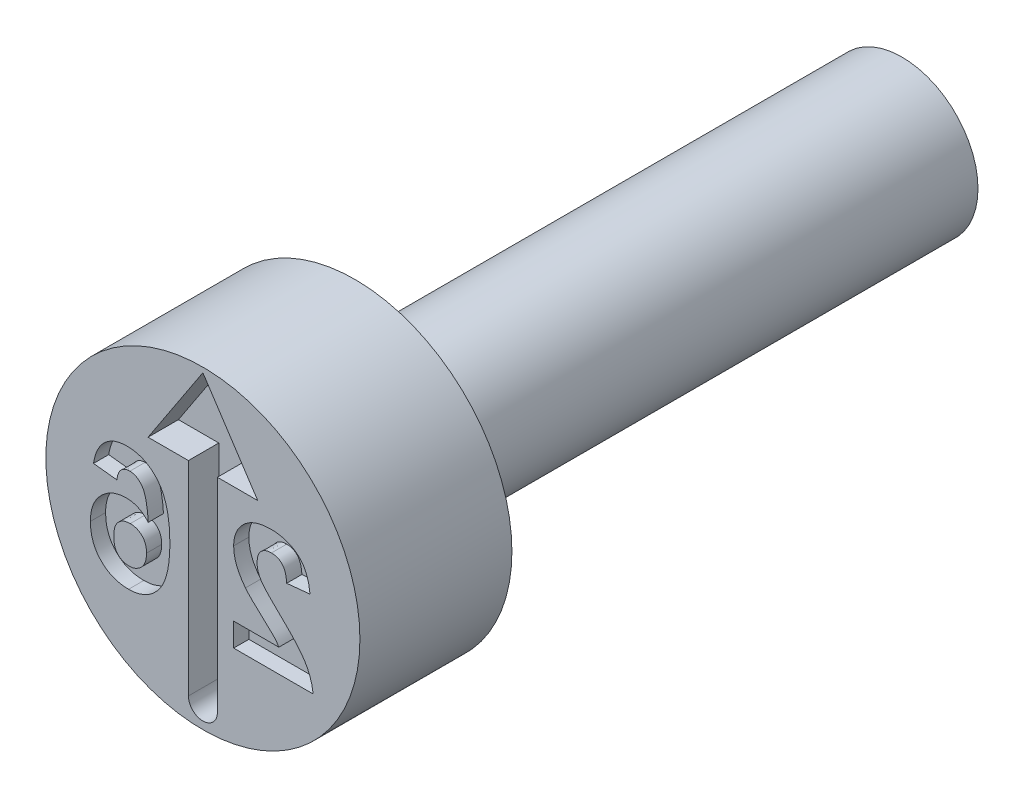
ISO-10303-21;
HEADER;
FILE_DESCRIPTION(('STEP AP214'),'2;1');
FILE_NAME('part.step','',(''),(''),'','','');
FILE_SCHEMA(('AUTOMOTIVE_DESIGN { 1 0 10303 214 1 1 1 1 }'));
ENDSEC;
DATA;
#1=APPLICATION_CONTEXT('core data for automotive mechanical design processes');
#2=APPLICATION_PROTOCOL_DEFINITION('international standard','automotive_design',2000,#1);
#3=PRODUCT_CONTEXT('',#1,'mechanical');
#4=PRODUCT('Part','Part','',(#3));
#5=PRODUCT_RELATED_PRODUCT_CATEGORY('part','',(#4));
#6=PRODUCT_DEFINITION_FORMATION('','',#4);
#7=PRODUCT_DEFINITION_CONTEXT('part definition',#1,'design');
#8=PRODUCT_DEFINITION('design','',#6,#7);
#9=PRODUCT_DEFINITION_SHAPE('','',#8);
#10=(LENGTH_UNIT() NAMED_UNIT(*) SI_UNIT(.MILLI.,.METRE.));
#11=(NAMED_UNIT(*) PLANE_ANGLE_UNIT() SI_UNIT($,.RADIAN.));
#12=(NAMED_UNIT(*) SI_UNIT($,.STERADIAN.) SOLID_ANGLE_UNIT());
#13=UNCERTAINTY_MEASURE_WITH_UNIT(LENGTH_MEASURE(1.E-05),#10,'distance_accuracy_value','');
#14=(GEOMETRIC_REPRESENTATION_CONTEXT(3) GLOBAL_UNCERTAINTY_ASSIGNED_CONTEXT((#13)) GLOBAL_UNIT_ASSIGNED_CONTEXT((#10,
#11,#12)) REPRESENTATION_CONTEXT('',''));
#15=CARTESIAN_POINT('',(0.,0.,0.));
#16=DIRECTION('',(0.,0.,1.));
#17=DIRECTION('',(1.,0.,0.));
#18=AXIS2_PLACEMENT_3D('',#15,#16,#17);
#19=CARTESIAN_POINT('',(0.,3.1,0.));
#20=DIRECTION('',(0.,0.,-1.));
#21=DIRECTION('',(-1.,0.,0.));
#22=AXIS2_PLACEMENT_3D('',#19,#20,#21);
#23=PLANE('',#22);
#24=DIRECTION('',(0.994071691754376,-0.108726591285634,0.));
#25=VECTOR('',#24,1.);
#26=CARTESIAN_POINT('',(-2.15907692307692,0.373557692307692,0.));
#27=LINE('',#26,#25);
#28=CARTESIAN_POINT('',(-2.15907692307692,0.373557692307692,0.));
#29=VERTEX_POINT('',#28);
#30=CARTESIAN_POINT('',(-1.69753846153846,0.323076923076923,0.));
#31=VERTEX_POINT('',#30);
#32=EDGE_CURVE('E334',#29,#31,#27,.T.);
#33=ORIENTED_EDGE('',*,*,#32,.F.);
#34=CARTESIAN_POINT('',(-1.50042307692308,1.,0.));
#35=CARTESIAN_POINT('',(-1.52208371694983,0.999610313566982,0.));
#36=CARTESIAN_POINT('',(-1.5644274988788,0.998848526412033,0.));
#37=CARTESIAN_POINT('',(-1.62648840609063,0.990758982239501,0.));
#38=CARTESIAN_POINT('',(-1.68569393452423,0.978388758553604,0.));
#39=CARTESIAN_POINT('',(-1.74219925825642,0.961265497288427,0.));
#40=CARTESIAN_POINT('',(-1.79560654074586,0.938334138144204,0.));
#41=CARTESIAN_POINT('',(-1.84612786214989,0.910398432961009,0.));
#42=CARTESIAN_POINT('',(-1.89393306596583,0.877534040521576,0.));
#43=CARTESIAN_POINT('',(-1.93877341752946,0.839952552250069,0.));
#44=CARTESIAN_POINT('',(-1.98028802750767,0.797540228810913,0.));
#45=CARTESIAN_POINT('',(-2.01777475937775,0.750201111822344,0.));
#46=CARTESIAN_POINT('',(-2.05148186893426,0.698506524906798,0.));
#47=CARTESIAN_POINT('',(-2.08155687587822,0.642499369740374,0.));
#48=CARTESIAN_POINT('',(-2.106783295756,0.581643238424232,0.));
#49=CARTESIAN_POINT('',(-2.12846956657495,0.516416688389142,0.));
#50=CARTESIAN_POINT('',(-2.1463050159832,0.446679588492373,0.));
#51=CARTESIAN_POINT('',(-2.15475470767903,0.398303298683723,0.));
#52=CARTESIAN_POINT('',(-2.15907692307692,0.373557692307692,0.));
#53=B_SPLINE_CURVE_WITH_KNOTS('',3,(#34,#35,#36,#37,#38,#39,#40,#41,#42,#43,#44,#45,#46,#47,#48,
#49,#50,#51,#52),.UNSPECIFIED.,.F.,.F.,(4,1,1,1,1,1,1,1,1,1,1,1,1,1,1,1,4),(0.,
0.0647517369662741,0.126581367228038,0.186839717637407,0.245514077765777,0.302849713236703,
0.360345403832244,0.417912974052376,0.47609188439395,0.535068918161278,0.59510381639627,
0.656390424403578,0.719434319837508,0.784953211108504,0.853160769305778,0.924888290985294,1.),.UNSPECIFIED.);
#54=CARTESIAN_POINT('',(-1.50042307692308,1.,0.));
#55=VERTEX_POINT('',#54);
#56=EDGE_CURVE('E54',#55,#29,#53,.T.);
#57=ORIENTED_EDGE('',*,*,#56,.F.);
#58=CARTESIAN_POINT('',(-0.651384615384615,-0.232211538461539,0.));
#59=CARTESIAN_POINT('',(-0.652102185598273,-0.179626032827,0.));
#60=CARTESIAN_POINT('',(-0.653488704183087,-0.0780181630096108,0.));
#61=CARTESIAN_POINT('',(-0.664645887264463,0.0686896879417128,0.));
#62=CARTESIAN_POINT('',(-0.682368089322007,0.20416815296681,0.));
#63=CARTESIAN_POINT('',(-0.708184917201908,0.328111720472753,0.));
#64=CARTESIAN_POINT('',(-0.741206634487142,0.440777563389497,0.));
#65=CARTESIAN_POINT('',(-0.781240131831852,0.542392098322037,0.));
#66=CARTESIAN_POINT('',(-0.829291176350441,0.632587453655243,0.));
#67=CARTESIAN_POINT('',(-0.885158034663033,0.711070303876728,0.));
#68=CARTESIAN_POINT('',(-0.946627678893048,0.779292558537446,0.));
#69=CARTESIAN_POINT('',(-1.01267708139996,0.838179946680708,0.));
#70=CARTESIAN_POINT('',(-1.08305408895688,0.888301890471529,0.));
#71=CARTESIAN_POINT('',(-1.15775701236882,0.929531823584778,0.));
#72=CARTESIAN_POINT('',(-1.23739910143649,0.960788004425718,0.));
#73=CARTESIAN_POINT('',(-1.32122492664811,0.983358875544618,0.));
#74=CARTESIAN_POINT('',(-1.4093752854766,0.997864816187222,0.));
#75=CARTESIAN_POINT('',(-1.46975688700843,0.999280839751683,0.));
#76=CARTESIAN_POINT('',(-1.50042307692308,1.,0.));
#77=B_SPLINE_CURVE_WITH_KNOTS('',3,(#58,#59,#60,#61,#62,#63,#64,#65,#66,#67,#68,#69,#70,#71,#72,
#73,#74,#75,#76),.UNSPECIFIED.,.F.,.F.,(4,1,1,1,1,1,1,1,1,1,1,1,1,1,1,1,4),(0.,
0.0932311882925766,0.180145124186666,0.260720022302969,0.335343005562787,0.40439372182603,
0.46866345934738,0.528671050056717,0.585123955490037,0.639046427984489,0.691174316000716,
0.741714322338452,0.79194664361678,0.842075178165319,0.893016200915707,0.945665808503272,1.),.UNSPECIFIED.);
#78=CARTESIAN_POINT('',(-0.651384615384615,-0.232211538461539,0.));
#79=VERTEX_POINT('',#78);
#80=EDGE_CURVE('E385',#79,#55,#77,.T.);
#81=ORIENTED_EDGE('',*,*,#80,.F.);
#82=CARTESIAN_POINT('',(-1.46580769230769,-1.43076923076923,0.));
#83=CARTESIAN_POINT('',(-1.43675417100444,-1.4299563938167,0.));
#84=CARTESIAN_POINT('',(-1.37962977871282,-1.42835821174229,0.));
#85=CARTESIAN_POINT('',(-1.29600601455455,-1.41520598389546,0.));
#86=CARTESIAN_POINT('',(-1.21650365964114,-1.39295449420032,0.));
#87=CARTESIAN_POINT('',(-1.14113259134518,-1.36187934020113,0.));
#88=CARTESIAN_POINT('',(-1.06926634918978,-1.32279160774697,0.));
#89=CARTESIAN_POINT('',(-1.00157226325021,-1.27423751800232,0.));
#90=CARTESIAN_POINT('',(-0.938229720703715,-1.21668009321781,0.));
#91=CARTESIAN_POINT('',(-0.87840091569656,-1.15089879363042,0.));
#92=CARTESIAN_POINT('',(-0.823958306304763,-1.07491619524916,0.));
#93=CARTESIAN_POINT('',(-0.7775945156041,-0.987096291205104,0.));
#94=CARTESIAN_POINT('',(-0.738273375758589,-0.888400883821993,0.));
#95=CARTESIAN_POINT('',(-0.706260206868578,-0.778576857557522,0.));
#96=CARTESIAN_POINT('',(-0.681548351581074,-0.657632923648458,0.));
#97=CARTESIAN_POINT('',(-0.664304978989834,-0.525558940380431,0.));
#98=CARTESIAN_POINT('',(-0.652851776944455,-0.382573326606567,0.));
#99=CARTESIAN_POINT('',(-0.651885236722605,-0.283517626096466,0.));
#100=CARTESIAN_POINT('',(-0.651384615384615,-0.232211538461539,0.));
#101=B_SPLINE_CURVE_WITH_KNOTS('',3,(#82,#83,#84,#85,#86,#87,#88,#89,#90,#91,#92,#93,#94,#95,
#96,#97,#98,#99,#100),.UNSPECIFIED.,.F.,.F.,(4,1,1,1,1,1,1,1,1,1,1,1,1,1,1,1,4),(0.,
0.0532594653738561,0.104717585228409,0.154775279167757,0.20433007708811,0.25391362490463,
0.304476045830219,0.356706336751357,0.410596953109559,0.467274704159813,0.52762561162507,
0.59224090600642,0.661798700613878,0.737130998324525,0.818387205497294,0.905933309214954,1.),.UNSPECIFIED.);
#102=CARTESIAN_POINT('',(-1.46580769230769,-1.43076923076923,0.));
#103=VERTEX_POINT('',#102);
#104=EDGE_CURVE('E377',#103,#79,#101,.T.);
#105=ORIENTED_EDGE('',*,*,#104,.F.);
#106=CARTESIAN_POINT('',(-2.22061538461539,-0.648076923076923,0.));
#107=CARTESIAN_POINT('',(-2.21994919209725,-0.676947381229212,0.));
#108=CARTESIAN_POINT('',(-2.21864995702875,-0.733251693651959,0.));
#109=CARTESIAN_POINT('',(-2.20908667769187,-0.815710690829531,0.));
#110=CARTESIAN_POINT('',(-2.19219386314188,-0.893542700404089,0.));
#111=CARTESIAN_POINT('',(-2.1691146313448,-0.967372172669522,0.));
#112=CARTESIAN_POINT('',(-2.13926231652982,-1.03661408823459,0.));
#113=CARTESIAN_POINT('',(-2.10309865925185,-1.10183907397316,0.));
#114=CARTESIAN_POINT('',(-2.05939985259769,-1.16193248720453,0.));
#115=CARTESIAN_POINT('',(-2.01014904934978,-1.21770267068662,0.));
#116=CARTESIAN_POINT('',(-1.95524415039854,-1.26747033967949,0.));
#117=CARTESIAN_POINT('',(-1.89673111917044,-1.311540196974,0.));
#118=CARTESIAN_POINT('',(-1.83396096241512,-1.34817418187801,0.));
#119=CARTESIAN_POINT('',(-1.76786150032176,-1.37900795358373,0.));
#120=CARTESIAN_POINT('',(-1.69729742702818,-1.4016358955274,0.));
#121=CARTESIAN_POINT('',(-1.62351277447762,-1.41860571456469,0.));
#122=CARTESIAN_POINT('',(-1.54590757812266,-1.4289557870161,0.));
#123=CARTESIAN_POINT('',(-1.49292299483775,-1.43015534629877,0.));
#124=CARTESIAN_POINT('',(-1.46580769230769,-1.43076923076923,0.));
#125=B_SPLINE_CURVE_WITH_KNOTS('',3,(#106,#107,#108,#109,#110,#111,#112,#113,#114,#115,#116,
#117,#118,#119,#120,#121,#122,#123,#124),.UNSPECIFIED.,.F.,.F.,(4,1,1,1,1,1,1,1,1,1,1,1,1,1,1,1,
4),(0.,0.0708046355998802,0.13808600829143,0.203231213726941,0.265884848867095,
0.327509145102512,0.387868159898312,0.448411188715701,0.509386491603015,0.570040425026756,
0.629864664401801,0.68871511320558,0.747985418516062,0.80839432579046,0.870086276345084,
0.933515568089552,1.),.UNSPECIFIED.);
#126=CARTESIAN_POINT('',(-2.22061538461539,-0.648076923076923,0.));
#127=VERTEX_POINT('',#126);
#128=EDGE_CURVE('E369',#127,#103,#125,.T.);
#129=ORIENTED_EDGE('',*,*,#128,.F.);
#130=CARTESIAN_POINT('',(-1.51148076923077,0.107692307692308,0.));
#131=CARTESIAN_POINT('',(-1.53538650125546,0.10700382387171,0.));
#132=CARTESIAN_POINT('',(-1.58259183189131,0.105644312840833,0.));
#133=CARTESIAN_POINT('',(-1.65213624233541,0.0961089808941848,0.));
#134=CARTESIAN_POINT('',(-1.71886867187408,0.0789627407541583,0.));
#135=CARTESIAN_POINT('',(-1.78309100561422,0.0557682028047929,0.));
#136=CARTESIAN_POINT('',(-1.84512065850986,0.0265604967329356,0.));
#137=CARTESIAN_POINT('',(-1.90377106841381,-0.0104120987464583,0.));
#138=CARTESIAN_POINT('',(-1.95996289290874,-0.053520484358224,0.));
#139=CARTESIAN_POINT('',(-2.01292332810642,-0.102771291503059,0.));
#140=CARTESIAN_POINT('',(-2.06158123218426,-0.156992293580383,0.));
#141=CARTESIAN_POINT('',(-2.10454134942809,-0.21555526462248,0.));
#142=CARTESIAN_POINT('',(-2.13989611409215,-0.27863904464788,0.));
#143=CARTESIAN_POINT('',(-2.17012020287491,-0.344831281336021,0.));
#144=CARTESIAN_POINT('',(-2.19260807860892,-0.415438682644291,0.));
#145=CARTESIAN_POINT('',(-2.20893189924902,-0.489445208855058,0.));
#146=CARTESIAN_POINT('',(-2.21867607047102,-0.567530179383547,0.));
#147=CARTESIAN_POINT('',(-2.21995877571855,-0.620805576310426,0.));
#148=CARTESIAN_POINT('',(-2.22061538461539,-0.648076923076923,0.));
#149=B_SPLINE_CURVE_WITH_KNOTS('',3,(#130,#131,#132,#133,#134,#135,#136,#137,#138,#139,#140,
#141,#142,#143,#144,#145,#146,#147,#148),.UNSPECIFIED.,.F.,.F.,(4,1,1,1,1,1,1,1,1,1,1,1,1,1,1,1,
4),(0.,0.0619593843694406,0.122347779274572,0.181484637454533,0.24021748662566,
0.299114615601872,0.358819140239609,0.419550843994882,0.482449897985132,0.545990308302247,
0.608137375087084,0.670271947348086,0.733113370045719,0.796428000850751,0.861936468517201,
0.9293261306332,1.),.UNSPECIFIED.);
#150=CARTESIAN_POINT('',(-1.51148076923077,0.107692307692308,0.));
#151=VERTEX_POINT('',#150);
#152=EDGE_CURVE('E361',#151,#127,#149,.T.);
#153=ORIENTED_EDGE('',*,*,#152,.F.);
#154=CARTESIAN_POINT('',(-1.07782692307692,-0.0932692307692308,0.));
#155=CARTESIAN_POINT('',(-1.09257775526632,-0.0772478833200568,0.));
#156=CARTESIAN_POINT('',(-1.12150258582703,-0.0458317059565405,0.));
#157=CARTESIAN_POINT('',(-1.16949800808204,-0.00487222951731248,0.));
#158=CARTESIAN_POINT('',(-1.21978035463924,0.0301453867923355,0.));
#159=CARTESIAN_POINT('',(-1.27289676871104,0.0588742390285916,0.));
#160=CARTESIAN_POINT('',(-1.32913717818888,0.0802534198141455,0.));
#161=CARTESIAN_POINT('',(-1.38748283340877,0.0964862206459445,0.));
#162=CARTESIAN_POINT('',(-1.44869748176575,0.105579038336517,0.));
#163=CARTESIAN_POINT('',(-1.49029869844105,0.106979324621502,0.));
#164=CARTESIAN_POINT('',(-1.51148076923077,0.107692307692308,0.));
#165=B_SPLINE_CURVE_WITH_KNOTS('',3,(#154,#155,#156,#157,#158,#159,#160,#161,#162,#163,#164),
.UNSPECIFIED.,.F.,.F.,(4,1,1,1,1,1,1,1,4),(0.,0.132218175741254,0.259265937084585,
0.382426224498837,0.503963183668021,0.625109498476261,0.747226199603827,0.871295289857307,1.),.UNSPECIFIED.);
#166=CARTESIAN_POINT('',(-1.07782692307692,-0.0932692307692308,0.));
#167=VERTEX_POINT('',#166);
#168=EDGE_CURVE('E353',#167,#151,#165,.T.);
#169=ORIENTED_EDGE('',*,*,#168,.F.);
#170=CARTESIAN_POINT('',(-1.44128846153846,0.6,0.));
#171=CARTESIAN_POINT('',(-1.42971317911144,0.599716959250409,0.));
#172=CARTESIAN_POINT('',(-1.40667895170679,0.599153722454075,0.));
#173=CARTESIAN_POINT('',(-1.37312680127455,0.592002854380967,0.));
#174=CARTESIAN_POINT('',(-1.34077849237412,0.581390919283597,0.));
#175=CARTESIAN_POINT('',(-1.30989803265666,0.566361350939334,0.));
#176=CARTESIAN_POINT('',(-1.28033134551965,0.546968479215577,0.));
#177=CARTESIAN_POINT('',(-1.25252791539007,0.522980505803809,0.));
#178=CARTESIAN_POINT('',(-1.22520950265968,0.495661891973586,0.));
#179=CARTESIAN_POINT('',(-1.199984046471,0.462673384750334,0.));
#180=CARTESIAN_POINT('',(-1.17578315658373,0.423612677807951,0.));
#181=CARTESIAN_POINT('',(-1.15494521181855,0.375795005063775,0.));
#182=CARTESIAN_POINT('',(-1.13637233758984,0.319264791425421,0.));
#183=CARTESIAN_POINT('',(-1.12046998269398,0.253745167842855,0.));
#184=CARTESIAN_POINT('',(-1.10603875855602,0.179652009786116,0.));
#185=CARTESIAN_POINT('',(-1.09420925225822,0.0966853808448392,0.));
#186=CARTESIAN_POINT('',(-1.08474335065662,0.00477073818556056,0.));
#187=CARTESIAN_POINT('',(-1.08020218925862,-0.0595999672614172,0.));
#188=CARTESIAN_POINT('',(-1.07782692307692,-0.0932692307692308,0.));
#189=B_SPLINE_CURVE_WITH_KNOTS('',3,(#170,#171,#172,#173,#174,#175,#176,#177,#178,#179,#180,
#181,#182,#183,#184,#185,#186,#187,#188),.UNSPECIFIED.,.F.,.F.,(4,1,1,1,1,1,1,1,1,1,1,1,1,1,1,1,
4),(0.,0.0401536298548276,0.0799036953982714,0.118642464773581,0.158240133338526,
0.198858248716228,0.241137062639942,0.285631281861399,0.332856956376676,0.385095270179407,
0.444912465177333,0.513585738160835,0.591645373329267,0.679009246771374,0.775790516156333,
0.882726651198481,1.),.UNSPECIFIED.);
#190=CARTESIAN_POINT('',(-1.44128846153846,0.6,0.));
#191=VERTEX_POINT('',#190);
#192=EDGE_CURVE('E345',#191,#167,#189,.T.);
#193=ORIENTED_EDGE('',*,*,#192,.F.);
#194=CARTESIAN_POINT('',(-1.69753846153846,0.323076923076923,0.));
#195=CARTESIAN_POINT('',(-1.69444630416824,0.345306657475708,0.));
#196=CARTESIAN_POINT('',(-1.68862742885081,0.38713895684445,0.));
#197=CARTESIAN_POINT('',(-1.67139221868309,0.444867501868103,0.));
#198=CARTESIAN_POINT('',(-1.64739885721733,0.493431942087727,0.));
#199=CARTESIAN_POINT('',(-1.61660105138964,0.53290018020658,0.));
#200=CARTESIAN_POINT('',(-1.57991762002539,0.56327657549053,0.));
#201=CARTESIAN_POINT('',(-1.53811883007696,0.584860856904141,0.));
#202=CARTESIAN_POINT('',(-1.49123124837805,0.597673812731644,0.));
#203=CARTESIAN_POINT('',(-1.45835793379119,0.599204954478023,0.));
#204=CARTESIAN_POINT('',(-1.44128846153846,0.6,0.));
#205=B_SPLINE_CURVE_WITH_KNOTS('',3,(#194,#195,#196,#197,#198,#199,#200,#201,#202,#203,#204),
.UNSPECIFIED.,.F.,.F.,(4,1,1,1,1,1,1,1,4),(0.,0.160089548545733,0.301259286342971,
0.428171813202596,0.544692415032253,0.65604141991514,0.765564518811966,0.878269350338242,1.),.UNSPECIFIED.);
#206=EDGE_CURVE('E340',#31,#191,#205,.T.);
#207=ORIENTED_EDGE('',*,*,#206,.F.);
#208=EDGE_LOOP('',(#33,#57,#81,#105,#129,#153,#169,#193,#207));
#209=FACE_BOUND('',#208,.T.);
#210=CARTESIAN_POINT('',(0.,0.,0.));
#211=DIRECTION('',(0.,0.,1.));
#212=DIRECTION('',(1.,0.,0.));
#213=AXIS2_PLACEMENT_3D('',#210,#211,#212);
#214=CIRCLE('',#213,3.1);
#215=CARTESIAN_POINT('',(3.1,0.,0.));
#216=VERTEX_POINT('',#215);
#217=EDGE_CURVE('E47',#216,#216,#214,.T.);
#218=ORIENTED_EDGE('',*,*,#217,.T.);
#219=EDGE_LOOP('',(#218));
#220=FACE_BOUND('',#219,.T.);
#221=DIRECTION('',(0.,1.,0.));
#222=VECTOR('',#221,1.);
#223=CARTESIAN_POINT('',(0.28570968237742,1.35952714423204,0.));
#224=LINE('',#223,#222);
#225=CARTESIAN_POINT('',(0.285709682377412,-2.66424275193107,0.));
#226=VERTEX_POINT('',#225);
#227=CARTESIAN_POINT('',(0.28570968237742,1.35952714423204,0.));
#228=VERTEX_POINT('',#227);
#229=EDGE_CURVE('E527',#226,#228,#224,.T.);
#230=ORIENTED_EDGE('',*,*,#229,.F.);
#231=CARTESIAN_POINT('',(2.4513673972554E-13,-2.66424275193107,0.));
#232=DIRECTION('',(0.,0.,1.));
#233=DIRECTION('',(1.,0.,0.));
#234=AXIS2_PLACEMENT_3D('',#231,#232,#233);
#235=CIRCLE('',#234,0.285709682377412);
#236=CARTESIAN_POINT('',(-0.285709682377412,-2.66424275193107,0.));
#237=VERTEX_POINT('',#236);
#238=EDGE_CURVE('E619',#237,#226,#235,.T.);
#239=ORIENTED_EDGE('',*,*,#238,.F.);
#240=DIRECTION('',(0.,-1.,0.));
#241=VECTOR('',#240,1.);
#242=CARTESIAN_POINT('',(-0.28570968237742,1.35952714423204,0.));
#243=LINE('',#242,#241);
#244=CARTESIAN_POINT('',(-0.28570968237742,1.35952714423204,0.));
#245=VERTEX_POINT('',#244);
#246=EDGE_CURVE('E649',#245,#237,#243,.T.);
#247=ORIENTED_EDGE('',*,*,#246,.F.);
#248=DIRECTION('',(1.,0.,0.));
#249=VECTOR('',#248,1.);
#250=CARTESIAN_POINT('',(-1.08287651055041,1.35952714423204,0.));
#251=LINE('',#250,#249);
#252=CARTESIAN_POINT('',(-1.08287651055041,1.35952714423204,0.));
#253=VERTEX_POINT('',#252);
#254=EDGE_CURVE('E679',#253,#245,#251,.T.);
#255=ORIENTED_EDGE('',*,*,#254,.F.);
#256=DIRECTION('',(-0.550159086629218,-0.835059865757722,0.));
#257=VECTOR('',#256,1.);
#258=CARTESIAN_POINT('',(0.,3.00317301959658,0.));
#259=LINE('',#258,#257);
#260=CARTESIAN_POINT('',(0.,3.00317301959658,0.));
#261=VERTEX_POINT('',#260);
#262=EDGE_CURVE('E676',#261,#253,#259,.T.);
#263=ORIENTED_EDGE('',*,*,#262,.F.);
#264=DIRECTION('',(-0.550159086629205,0.835059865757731,0.));
#265=VECTOR('',#264,1.);
#266=CARTESIAN_POINT('',(0.,3.00317301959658,0.));
#267=LINE('',#266,#265);
#268=CARTESIAN_POINT('',(1.08287651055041,1.35952714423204,0.));
#269=VERTEX_POINT('',#268);
#270=EDGE_CURVE('E673',#269,#261,#267,.T.);
#271=ORIENTED_EDGE('',*,*,#270,.F.);
#272=DIRECTION('',(1.,0.,0.));
#273=VECTOR('',#272,1.);
#274=CARTESIAN_POINT('',(1.08287651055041,1.35952714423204,0.));
#275=LINE('',#274,#273);
#276=EDGE_CURVE('E670',#228,#269,#275,.T.);
#277=ORIENTED_EDGE('',*,*,#276,.F.);
#278=EDGE_LOOP('',(#230,#239,#247,#255,#263,#271,#277));
#279=FACE_BOUND('',#278,.T.);
#280=DIRECTION('',(0.,-1.,0.));
#281=VECTOR('',#280,1.);
#282=CARTESIAN_POINT('',(0.607692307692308,-0.938461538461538,0.));
#283=LINE('',#282,#281);
#284=CARTESIAN_POINT('',(0.607692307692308,-0.938461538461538,0.));
#285=VERTEX_POINT('',#284);
#286=CARTESIAN_POINT('',(0.607692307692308,-1.4,0.));
#287=VERTEX_POINT('',#286);
#288=EDGE_CURVE('E532',#285,#287,#283,.T.);
#289=ORIENTED_EDGE('',*,*,#288,.F.);
#290=DIRECTION('',(-1.,0.,0.));
#291=VECTOR('',#290,1.);
#292=CARTESIAN_POINT('',(1.49951923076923,-0.938461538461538,0.));
#293=LINE('',#292,#291);
#294=CARTESIAN_POINT('',(1.49951923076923,-0.938461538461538,0.));
#295=VERTEX_POINT('',#294);
#296=EDGE_CURVE('E399',#295,#285,#293,.T.);
#297=ORIENTED_EDGE('',*,*,#296,.F.);
#298=CARTESIAN_POINT('',(0.840384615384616,-0.254807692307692,0.));
#299=CARTESIAN_POINT('',(0.847684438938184,-0.264001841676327,0.));
#300=CARTESIAN_POINT('',(0.86331896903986,-0.283693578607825,0.));
#301=CARTESIAN_POINT('',(0.889917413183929,-0.313887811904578,0.));
#302=CARTESIAN_POINT('',(0.920742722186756,-0.346869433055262,0.));
#303=CARTESIAN_POINT('',(0.955359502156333,-0.383255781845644,0.));
#304=CARTESIAN_POINT('',(0.994911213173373,-0.421758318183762,0.));
#305=CARTESIAN_POINT('',(1.03797478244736,-0.463987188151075,0.));
#306=CARTESIAN_POINT('',(1.0864451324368,-0.50778224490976,0.));
#307=CARTESIAN_POINT('',(1.13664866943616,-0.554235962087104,0.));
#308=CARTESIAN_POINT('',(1.1870704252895,-0.599448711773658,0.));
#309=CARTESIAN_POINT('',(1.23341528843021,-0.642390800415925,0.));
#310=CARTESIAN_POINT('',(1.27551184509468,-0.680385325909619,0.));
#311=CARTESIAN_POINT('',(1.31139957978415,-0.715529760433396,0.));
#312=CARTESIAN_POINT('',(1.34318940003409,-0.745425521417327,0.));
#313=CARTESIAN_POINT('',(1.36973549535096,-0.771605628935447,0.));
#314=CARTESIAN_POINT('',(1.39153460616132,-0.79343628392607,0.));
#315=CARTESIAN_POINT('',(1.42157237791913,-0.827464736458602,0.));
#316=CARTESIAN_POINT('',(1.45979203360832,-0.873488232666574,0.));
#317=CARTESIAN_POINT('',(1.48668112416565,-0.917464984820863,0.));
#318=CARTESIAN_POINT('',(1.49951923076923,-0.938461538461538,0.));
#319=B_SPLINE_CURVE_WITH_KNOTS('',3,(#298,#299,#300,#301,#302,#303,#304,#305,#306,#307,#308,
#309,#310,#311,#312,#313,#314,#315,#316,#317,#318),.UNSPECIFIED.,.F.,.F.,(4,1,1,1,1,1,1,1,1,1,1,
1,1,1,1,1,1,1,4),(0.,0.0369753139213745,0.0791925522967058,0.126700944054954,0.179184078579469,
0.23736864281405,0.300558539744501,0.369153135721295,0.443112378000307,0.516018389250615,
0.582473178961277,0.642136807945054,0.694619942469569,0.740679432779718,0.779589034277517,
0.812073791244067,0.837814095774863,0.922564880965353,1.),.UNSPECIFIED.);
#320=CARTESIAN_POINT('',(0.840384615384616,-0.254807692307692,0.));
#321=VERTEX_POINT('',#320);
#322=EDGE_CURVE('E419',#321,#295,#319,.T.);
#323=ORIENTED_EDGE('',*,*,#322,.F.);
#324=CARTESIAN_POINT('',(0.607692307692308,0.347115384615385,0.));
#325=CARTESIAN_POINT('',(0.608279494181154,0.320954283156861,0.));
#326=CARTESIAN_POINT('',(0.609444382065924,0.269054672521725,0.));
#327=CARTESIAN_POINT('',(0.620597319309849,0.192331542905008,0.));
#328=CARTESIAN_POINT('',(0.637636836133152,0.117377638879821,0.));
#329=CARTESIAN_POINT('',(0.662819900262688,0.0440097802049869,0.));
#330=CARTESIAN_POINT('',(0.694741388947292,-0.0295319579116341,0.));
#331=CARTESIAN_POINT('',(0.735888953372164,-0.103412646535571,0.));
#332=CARTESIAN_POINT('',(0.78366438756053,-0.179860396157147,0.));
#333=CARTESIAN_POINT('',(0.821070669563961,-0.229287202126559,0.));
#334=CARTESIAN_POINT('',(0.840384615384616,-0.254807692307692,0.));
#335=B_SPLINE_CURVE_WITH_KNOTS('',3,(#324,#325,#326,#327,#328,#329,#330,#331,#332,#333,#334),
.UNSPECIFIED.,.F.,.F.,(4,1,1,1,1,1,1,1,4),(0.,0.119176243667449,0.236427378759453,
0.352663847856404,0.469086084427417,0.589462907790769,0.717601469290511,0.854189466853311,1.),.UNSPECIFIED.);
#336=CARTESIAN_POINT('',(0.607692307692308,0.347115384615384,0.));
#337=VERTEX_POINT('',#336);
#338=EDGE_CURVE('E599',#337,#321,#335,.T.);
#339=ORIENTED_EDGE('',*,*,#338,.F.);
#340=CARTESIAN_POINT('',(1.34423076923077,1.,0.));
#341=CARTESIAN_POINT('',(1.31632550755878,0.999463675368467,0.));
#342=CARTESIAN_POINT('',(1.26197650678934,0.998419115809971,0.));
#343=CARTESIAN_POINT('',(1.18263661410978,0.989793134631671,0.));
#344=CARTESIAN_POINT('',(1.10810248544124,0.974752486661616,0.));
#345=CARTESIAN_POINT('',(1.03772249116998,0.954829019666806,0.));
#346=CARTESIAN_POINT('',(0.972219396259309,0.928229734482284,0.));
#347=CARTESIAN_POINT('',(0.911047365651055,0.896072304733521,0.));
#348=CARTESIAN_POINT('',(0.855169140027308,0.857136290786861,0.));
#349=CARTESIAN_POINT('',(0.803751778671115,0.813545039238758,0.));
#350=CARTESIAN_POINT('',(0.757788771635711,0.765608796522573,0.));
#351=CARTESIAN_POINT('',(0.717529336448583,0.714476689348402,0.));
#352=CARTESIAN_POINT('',(0.683800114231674,0.660184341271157,0.));
#353=CARTESIAN_POINT('',(0.655496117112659,0.603393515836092,0.));
#354=CARTESIAN_POINT('',(0.634480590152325,0.543190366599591,0.));
#355=CARTESIAN_POINT('',(0.619167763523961,0.480407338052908,0.));
#356=CARTESIAN_POINT('',(0.609014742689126,0.41475153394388,0.));
#357=CARTESIAN_POINT('',(0.608137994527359,0.369910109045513,0.));
#358=CARTESIAN_POINT('',(0.607692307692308,0.347115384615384,0.));
#359=B_SPLINE_CURVE_WITH_KNOTS('',3,(#340,#341,#342,#343,#344,#345,#346,#347,#348,#349,#350,
#351,#352,#353,#354,#355,#356,#357,#358),.UNSPECIFIED.,.F.,.F.,(4,1,1,1,1,1,1,1,1,1,1,1,1,1,1,1,
4),(0.,0.0756723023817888,0.147381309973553,0.216084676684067,0.28169803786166,
0.345459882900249,0.407485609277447,0.46873129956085,0.529782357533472,0.590032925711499,
0.648548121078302,0.70595351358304,0.763101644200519,0.820289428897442,0.878479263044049,
0.938226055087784,1.),.UNSPECIFIED.);
#360=CARTESIAN_POINT('',(1.34423076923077,1.,0.));
#361=VERTEX_POINT('',#360);
#362=EDGE_CURVE('E591',#361,#337,#359,.T.);
#363=ORIENTED_EDGE('',*,*,#362,.F.);
#364=CARTESIAN_POINT('',(2.11538461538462,0.275961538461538,0.));
#365=CARTESIAN_POINT('',(2.11167391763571,0.307121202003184,0.));
#366=CARTESIAN_POINT('',(2.10447946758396,0.367534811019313,0.));
#367=CARTESIAN_POINT('',(2.08652559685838,0.454309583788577,0.));
#368=CARTESIAN_POINT('',(2.06378768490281,0.534363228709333,0.));
#369=CARTESIAN_POINT('',(2.03518173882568,0.607547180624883,0.));
#370=CARTESIAN_POINT('',(2.00189007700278,0.674326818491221,0.));
#371=CARTESIAN_POINT('',(1.96221454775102,0.733700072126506,0.));
#372=CARTESIAN_POINT('',(1.91754145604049,0.786324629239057,0.));
#373=CARTESIAN_POINT('',(1.86783219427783,0.832172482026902,0.));
#374=CARTESIAN_POINT('',(1.8134027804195,0.871389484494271,0.));
#375=CARTESIAN_POINT('',(1.75628887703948,0.906396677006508,0.));
#376=CARTESIAN_POINT('',(1.69537431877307,0.935113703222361,0.));
#377=CARTESIAN_POINT('',(1.63132977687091,0.958780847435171,0.));
#378=CARTESIAN_POINT('',(1.56418419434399,0.977695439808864,0.));
#379=CARTESIAN_POINT('',(1.49362701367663,0.990201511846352,0.));
#380=CARTESIAN_POINT('',(1.42009368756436,0.998998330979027,0.));
#381=CARTESIAN_POINT('',(1.36989953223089,0.999661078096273,0.));
#382=CARTESIAN_POINT('',(1.34423076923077,1.,0.));
#383=B_SPLINE_CURVE_WITH_KNOTS('',3,(#364,#365,#366,#367,#368,#369,#370,#371,#372,#373,#374,
#375,#376,#377,#378,#379,#380,#381,#382),.UNSPECIFIED.,.F.,.F.,(4,1,1,1,1,1,1,1,1,1,1,1,1,1,1,1,
4),(0.,0.0794357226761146,0.154013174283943,0.224141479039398,0.289934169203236,
0.352732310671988,0.412725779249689,0.470302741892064,0.527168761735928,0.583502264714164,
0.639948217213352,0.696584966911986,0.753726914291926,0.812707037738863,0.872963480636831,
0.935034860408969,1.),.UNSPECIFIED.);
#384=CARTESIAN_POINT('',(2.11538461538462,0.275961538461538,0.));
#385=VERTEX_POINT('',#384);
#386=EDGE_CURVE('E586',#385,#361,#383,.T.);
#387=ORIENTED_EDGE('',*,*,#386,.F.);
#388=DIRECTION('',(0.995240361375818,0.0974506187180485,0.));
#389=VECTOR('',#388,1.);
#390=CARTESIAN_POINT('',(1.65384615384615,0.230769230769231,0.));
#391=LINE('',#390,#389);
#392=CARTESIAN_POINT('',(1.65384615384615,0.230769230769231,0.));
#393=VERTEX_POINT('',#392);
#394=EDGE_CURVE('E580',#393,#385,#391,.T.);
#395=ORIENTED_EDGE('',*,*,#394,.F.);
#396=CARTESIAN_POINT('',(1.35384615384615,0.6,0.));
#397=CARTESIAN_POINT('',(1.37477952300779,0.59905158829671,0.));
#398=CARTESIAN_POINT('',(1.41521827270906,0.59721946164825,0.));
#399=CARTESIAN_POINT('',(1.4726905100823,0.581214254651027,0.));
#400=CARTESIAN_POINT('',(1.52296811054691,0.55350755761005,0.));
#401=CARTESIAN_POINT('',(1.55879860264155,0.521933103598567,0.));
#402=CARTESIAN_POINT('',(1.58300379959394,0.491229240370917,0.));
#403=CARTESIAN_POINT('',(1.59949637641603,0.464472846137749,0.));
#404=CARTESIAN_POINT('',(1.6137116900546,0.434069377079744,0.));
#405=CARTESIAN_POINT('',(1.62630764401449,0.400361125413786,0.));
#406=CARTESIAN_POINT('',(1.63625702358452,0.362961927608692,0.));
#407=CARTESIAN_POINT('',(1.64426963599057,0.32215661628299,0.));
#408=CARTESIAN_POINT('',(1.65072664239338,0.277725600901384,0.));
#409=CARTESIAN_POINT('',(1.65278008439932,0.246816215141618,0.));
#410=CARTESIAN_POINT('',(1.65384615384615,0.230769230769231,0.));
#411=B_SPLINE_CURVE_WITH_KNOTS('',3,(#396,#397,#398,#399,#400,#401,#402,#403,#404,#405,#406,
#407,#408,#409,#410),.UNSPECIFIED.,.F.,.F.,(4,1,1,1,1,1,1,1,1,1,1,1,4),(0.,0.116899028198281,
0.225823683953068,0.330086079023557,0.435451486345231,0.490306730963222,0.548244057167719,
0.610766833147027,0.677675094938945,0.749188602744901,0.826858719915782,0.910111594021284,1.),.UNSPECIFIED.);
#412=CARTESIAN_POINT('',(1.35384615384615,0.6,0.));
#413=VERTEX_POINT('',#412);
#414=EDGE_CURVE('E572',#413,#393,#411,.T.);
#415=ORIENTED_EDGE('',*,*,#414,.F.);
#416=CARTESIAN_POINT('',(1.06923076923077,0.285096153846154,0.));
#417=CARTESIAN_POINT('',(1.07009516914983,0.309041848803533,0.));
#418=CARTESIAN_POINT('',(1.07173054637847,0.354345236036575,0.));
#419=CARTESIAN_POINT('',(1.08544346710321,0.418276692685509,0.));
#420=CARTESIAN_POINT('',(1.10976110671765,0.473234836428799,0.));
#421=CARTESIAN_POINT('',(1.14324202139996,0.519388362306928,0.));
#422=CARTESIAN_POINT('',(1.1855787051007,0.555549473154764,0.));
#423=CARTESIAN_POINT('',(1.23507151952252,0.582269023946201,0.));
#424=CARTESIAN_POINT('',(1.29244496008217,0.597041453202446,0.));
#425=CARTESIAN_POINT('',(1.33277039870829,0.5989844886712,0.));
#426=CARTESIAN_POINT('',(1.35384615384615,0.6,0.));
#427=B_SPLINE_CURVE_WITH_KNOTS('',3,(#416,#417,#418,#419,#420,#421,#422,#423,#424,#425,#426),
.UNSPECIFIED.,.F.,.F.,(4,1,1,1,1,1,1,1,4),(0.,0.149140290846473,0.282161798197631,
0.404655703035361,0.521109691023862,0.634416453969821,0.748796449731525,0.868710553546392,1.),.UNSPECIFIED.);
#428=CARTESIAN_POINT('',(1.06923076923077,0.285096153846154,0.));
#429=VERTEX_POINT('',#428);
#430=EDGE_CURVE('E564',#429,#413,#427,.T.);
#431=ORIENTED_EDGE('',*,*,#430,.F.);
#432=CARTESIAN_POINT('',(1.16057692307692,0.00769230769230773,0.));
#433=CARTESIAN_POINT('',(1.14668104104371,0.0307748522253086,0.));
#434=CARTESIAN_POINT('',(1.11987749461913,0.0752984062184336,0.));
#435=CARTESIAN_POINT('',(1.09048518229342,0.145312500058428,0.));
#436=CARTESIAN_POINT('',(1.07284282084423,0.215312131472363,0.));
#437=CARTESIAN_POINT('',(1.07042181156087,0.262085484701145,0.));
#438=CARTESIAN_POINT('',(1.06923076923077,0.285096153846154,0.));
#439=B_SPLINE_CURVE_WITH_KNOTS('',3,(#432,#433,#434,#435,#436,#437,#438),.UNSPECIFIED.,.F.,.F.,
(4,1,1,1,4),(0.,0.272795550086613,0.526191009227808,0.766904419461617,1.),.UNSPECIFIED.);
#440=CARTESIAN_POINT('',(1.16057692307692,0.00769230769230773,0.));
#441=VERTEX_POINT('',#440);
#442=EDGE_CURVE('E556',#441,#429,#439,.T.);
#443=ORIENTED_EDGE('',*,*,#442,.F.);
#444=CARTESIAN_POINT('',(1.52788461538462,-0.379807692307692,0.));
#445=CARTESIAN_POINT('',(1.50415574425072,-0.356902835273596,0.));
#446=CARTESIAN_POINT('',(1.45898296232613,-0.31329873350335,0.));
#447=CARTESIAN_POINT('',(1.39465683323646,-0.250859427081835,0.));
#448=CARTESIAN_POINT('',(1.33810753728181,-0.193459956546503,0.));
#449=CARTESIAN_POINT('',(1.28815270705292,-0.142587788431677,0.));
#450=CARTESIAN_POINT('',(1.24594636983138,-0.096947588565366,0.));
#451=CARTESIAN_POINT('',(1.2109333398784,-0.0572561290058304,0.));
#452=CARTESIAN_POINT('',(1.18267018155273,-0.0233517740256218,0.));
#453=CARTESIAN_POINT('',(1.16736283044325,-0.00184283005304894,0.));
#454=CARTESIAN_POINT('',(1.16057692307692,0.00769230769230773,0.));
#455=B_SPLINE_CURVE_WITH_KNOTS('',3,(#444,#445,#446,#447,#448,#449,#450,#451,#452,#453,#454),
.UNSPECIFIED.,.F.,.F.,(4,1,1,1,1,1,1,1,4),(0.,0.18509006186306,0.352356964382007,
0.503079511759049,0.637279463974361,0.752473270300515,0.851885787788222,0.934339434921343,1.),.UNSPECIFIED.);
#456=CARTESIAN_POINT('',(1.52788461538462,-0.379807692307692,0.));
#457=VERTEX_POINT('',#456);
#458=EDGE_CURVE('E548',#457,#441,#455,.T.);
#459=ORIENTED_EDGE('',*,*,#458,.F.);
#460=CARTESIAN_POINT('',(2.17692307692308,-1.4,0.));
#461=CARTESIAN_POINT('',(2.17161002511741,-1.3605548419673,0.));
#462=CARTESIAN_POINT('',(2.16098690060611,-1.28168664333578,0.));
#463=CARTESIAN_POINT('',(2.12814399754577,-1.16648005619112,0.));
#464=CARTESIAN_POINT('',(2.08430997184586,-1.05405811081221,0.));
#465=CARTESIAN_POINT('',(2.03673646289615,-0.962573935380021,0.));
#466=CARTESIAN_POINT('',(1.98941933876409,-0.888932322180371,0.));
#467=CARTESIAN_POINT('',(1.94648850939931,-0.82858981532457,0.));
#468=CARTESIAN_POINT('',(1.89527360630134,-0.764387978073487,0.));
#469=CARTESIAN_POINT('',(1.83651781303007,-0.695808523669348,0.));
#470=CARTESIAN_POINT('',(1.77054583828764,-0.622637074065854,0.));
#471=CARTESIAN_POINT('',(1.69686548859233,-0.54514566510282,0.));
#472=CARTESIAN_POINT('',(1.61512529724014,-0.463705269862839,0.));
#473=CARTESIAN_POINT('',(1.5576196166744,-0.408403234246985,0.));
#474=CARTESIAN_POINT('',(1.52788461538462,-0.379807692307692,0.));
#475=B_SPLINE_CURVE_WITH_KNOTS('',3,(#460,#461,#462,#463,#464,#465,#466,#467,#468,#469,#470,
#471,#472,#473,#474),.UNSPECIFIED.,.F.,.F.,(4,1,1,1,1,1,1,1,1,1,1,1,4),(0.,0.0963574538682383,
0.192660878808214,0.289454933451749,0.388479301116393,0.441921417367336,0.501521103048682,
0.567882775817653,0.640891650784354,0.72037065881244,0.806636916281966,0.900015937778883,1.),.UNSPECIFIED.);
#476=CARTESIAN_POINT('',(2.17692307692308,-1.4,0.));
#477=VERTEX_POINT('',#476);
#478=EDGE_CURVE('E539',#477,#457,#475,.T.);
#479=ORIENTED_EDGE('',*,*,#478,.F.);
#480=DIRECTION('',(1.,0.,0.));
#481=VECTOR('',#480,1.);
#482=CARTESIAN_POINT('',(0.607692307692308,-1.4,0.));
#483=LINE('',#482,#481);
#484=EDGE_CURVE('E536',#287,#477,#483,.T.);
#485=ORIENTED_EDGE('',*,*,#484,.F.);
#486=EDGE_LOOP('',(#289,#297,#323,#339,#363,#387,#395,#415,#431,#443,#459,#479,#485));
#487=FACE_BOUND('',#486,.T.);
#488=ADVANCED_FACE('F39',(#209,#220,#279,#487),#23,.F.);
#489=CARTESIAN_POINT('',(0.,1.5,-3.));
#490=DIRECTION('',(0.,0.,1.));
#491=DIRECTION('',(1.,0.,0.));
#492=AXIS2_PLACEMENT_3D('',#489,#490,#491);
#493=PLANE('',#492);
#494=CARTESIAN_POINT('',(0.,0.,-3.));
#495=DIRECTION('',(0.,0.,1.));
#496=DIRECTION('',(1.,0.,0.));
#497=AXIS2_PLACEMENT_3D('',#494,#495,#496);
#498=CIRCLE('',#497,3.1);
#499=CARTESIAN_POINT('',(3.1,0.,-3.));
#500=VERTEX_POINT('',#499);
#501=EDGE_CURVE('E11',#500,#500,#498,.T.);
#502=ORIENTED_EDGE('',*,*,#501,.F.);
#503=EDGE_LOOP('',(#502));
#504=FACE_BOUND('',#503,.T.);
#505=CARTESIAN_POINT('',(0.,0.,-3.));
#506=DIRECTION('',(0.,0.,1.));
#507=DIRECTION('',(1.,0.,0.));
#508=AXIS2_PLACEMENT_3D('',#505,#506,#507);
#509=CIRCLE('',#508,1.5);
#510=CARTESIAN_POINT('',(1.5,0.,-3.));
#511=VERTEX_POINT('',#510);
#512=EDGE_CURVE('E686',#511,#511,#509,.T.);
#513=ORIENTED_EDGE('',*,*,#512,.T.);
#514=EDGE_LOOP('',(#513));
#515=FACE_BOUND('',#514,.T.);
#516=ADVANCED_FACE('F41',(#504,#515),#493,.F.);
#517=CARTESIAN_POINT('',(0.,0.,-0.403888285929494));
#518=DIRECTION('',(0.,0.,1.));
#519=DIRECTION('',(1.,0.,0.));
#520=AXIS2_PLACEMENT_3D('',#517,#518,#519);
#521=CYLINDRICAL_SURFACE('',#520,3.1);
#522=ORIENTED_EDGE('',*,*,#217,.F.);
#523=EDGE_LOOP('',(#522));
#524=FACE_BOUND('',#523,.T.);
#525=ORIENTED_EDGE('',*,*,#501,.T.);
#526=EDGE_LOOP('',(#525));
#527=FACE_BOUND('',#526,.T.);
#528=ADVANCED_FACE('F499',(#524,#527),#521,.T.);
#529=CARTESIAN_POINT('',(0.,0.,-13.8));
#530=DIRECTION('',(0.,0.,1.));
#531=DIRECTION('',(1.,0.,0.));
#532=AXIS2_PLACEMENT_3D('',#529,#530,#531);
#533=PLANE('',#532);
#534=CARTESIAN_POINT('',(0.,0.,-13.8));
#535=DIRECTION('',(0.,0.,1.));
#536=DIRECTION('',(1.,0.,0.));
#537=AXIS2_PLACEMENT_3D('',#534,#535,#536);
#538=CIRCLE('',#537,1.5);
#539=CARTESIAN_POINT('',(1.5,0.,-13.8));
#540=VERTEX_POINT('',#539);
#541=EDGE_CURVE('E701',#540,#540,#538,.T.);
#542=ORIENTED_EDGE('',*,*,#541,.F.);
#543=EDGE_LOOP('',(#542));
#544=FACE_BOUND('',#543,.T.);
#545=ADVANCED_FACE('F495',(#544),#533,.F.);
#546=CARTESIAN_POINT('',(0.,0.,-0.403888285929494));
#547=DIRECTION('',(0.,0.,1.));
#548=DIRECTION('',(1.,0.,0.));
#549=AXIS2_PLACEMENT_3D('',#546,#547,#548);
#550=CYLINDRICAL_SURFACE('',#549,1.5);
#551=ORIENTED_EDGE('',*,*,#512,.F.);
#552=EDGE_LOOP('',(#551));
#553=FACE_BOUND('',#552,.T.);
#554=ORIENTED_EDGE('',*,*,#541,.T.);
#555=EDGE_LOOP('',(#554));
#556=FACE_BOUND('',#555,.T.);
#557=ADVANCED_FACE('F491',(#553,#556),#550,.T.);
#558=CARTESIAN_POINT('',(2.4513673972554E-13,-2.66424275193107,-0.6));
#559=DIRECTION('',(0.,0.,1.));
#560=DIRECTION('',(1.,0.,0.));
#561=AXIS2_PLACEMENT_3D('',#558,#559,#560);
#562=CYLINDRICAL_SURFACE('',#561,0.285709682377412);
#563=ORIENTED_EDGE('',*,*,#238,.T.);
#564=DIRECTION('',(0.,0.,1.));
#565=VECTOR('',#564,1.);
#566=CARTESIAN_POINT('',(0.285709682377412,-2.66424275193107,-0.6));
#567=LINE('',#566,#565);
#568=CARTESIAN_POINT('',(0.285709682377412,-2.66424275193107,-0.6));
#569=VERTEX_POINT('',#568);
#570=EDGE_CURVE('E667',#569,#226,#567,.T.);
#571=ORIENTED_EDGE('',*,*,#570,.F.);
#572=CARTESIAN_POINT('',(2.4513673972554E-13,-2.66424275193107,-0.6));
#573=DIRECTION('',(0.,0.,1.));
#574=DIRECTION('',(1.,0.,0.));
#575=AXIS2_PLACEMENT_3D('',#572,#573,#574);
#576=CIRCLE('',#575,0.285709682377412);
#577=CARTESIAN_POINT('',(-0.285709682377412,-2.66424275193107,-0.6));
#578=VERTEX_POINT('',#577);
#579=EDGE_CURVE('E645',#578,#569,#576,.T.);
#580=ORIENTED_EDGE('',*,*,#579,.F.);
#581=DIRECTION('',(0.,0.,1.));
#582=VECTOR('',#581,1.);
#583=CARTESIAN_POINT('',(-0.285709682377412,-2.66424275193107,-0.6));
#584=LINE('',#583,#582);
#585=EDGE_CURVE('E684',#578,#237,#584,.T.);
#586=ORIENTED_EDGE('',*,*,#585,.T.);
#587=EDGE_LOOP('',(#563,#571,#580,#586));
#588=FACE_BOUND('',#587,.T.);
#589=ADVANCED_FACE('F469',(#588),#562,.F.);
#590=CARTESIAN_POINT('',(-0.28570968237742,1.35952714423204,-0.6));
#591=DIRECTION('',(-1.,0.,0.));
#592=DIRECTION('',(0.,-1.,0.));
#593=AXIS2_PLACEMENT_3D('',#590,#591,#592);
#594=PLANE('',#593);
#595=ORIENTED_EDGE('',*,*,#246,.T.);
#596=ORIENTED_EDGE('',*,*,#585,.F.);
#597=DIRECTION('',(0.,-1.,0.));
#598=VECTOR('',#597,1.);
#599=CARTESIAN_POINT('',(-0.28570968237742,1.35952714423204,-0.6));
#600=LINE('',#599,#598);
#601=CARTESIAN_POINT('',(-0.28570968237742,1.35952714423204,-0.6));
#602=VERTEX_POINT('',#601);
#603=EDGE_CURVE('E664',#602,#578,#600,.T.);
#604=ORIENTED_EDGE('',*,*,#603,.F.);
#605=DIRECTION('',(0.,0.,1.));
#606=VECTOR('',#605,1.);
#607=CARTESIAN_POINT('',(-0.28570968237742,1.35952714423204,-0.6));
#608=LINE('',#607,#606);
#609=EDGE_CURVE('E687',#602,#245,#608,.T.);
#610=ORIENTED_EDGE('',*,*,#609,.T.);
#611=EDGE_LOOP('',(#595,#596,#604,#610));
#612=FACE_BOUND('',#611,.T.);
#613=ADVANCED_FACE('F465',(#612),#594,.F.);
#614=CARTESIAN_POINT('',(-1.08287651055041,1.35952714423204,-0.6));
#615=DIRECTION('',(0.,-1.,0.));
#616=DIRECTION('',(0.,0.,-1.));
#617=AXIS2_PLACEMENT_3D('',#614,#615,#616);
#618=PLANE('',#617);
#619=ORIENTED_EDGE('',*,*,#254,.T.);
#620=ORIENTED_EDGE('',*,*,#609,.F.);
#621=DIRECTION('',(1.,0.,0.));
#622=VECTOR('',#621,1.);
#623=CARTESIAN_POINT('',(-1.08287651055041,1.35952714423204,-0.6));
#624=LINE('',#623,#622);
#625=CARTESIAN_POINT('',(-1.08287651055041,1.35952714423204,-0.6));
#626=VERTEX_POINT('',#625);
#627=EDGE_CURVE('E661',#626,#602,#624,.T.);
#628=ORIENTED_EDGE('',*,*,#627,.F.);
#629=DIRECTION('',(0.,0.,1.));
#630=VECTOR('',#629,1.);
#631=CARTESIAN_POINT('',(-1.08287651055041,1.35952714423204,-0.6));
#632=LINE('',#631,#630);
#633=EDGE_CURVE('E689',#626,#253,#632,.T.);
#634=ORIENTED_EDGE('',*,*,#633,.T.);
#635=EDGE_LOOP('',(#619,#620,#628,#634));
#636=FACE_BOUND('',#635,.T.);
#637=ADVANCED_FACE('F468',(#636),#618,.F.);
#638=CARTESIAN_POINT('',(0.,3.00317301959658,-0.6));
#639=DIRECTION('',(-0.835059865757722,0.550159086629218,0.));
#640=DIRECTION('',(-0.550159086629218,-0.835059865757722,0.));
#641=AXIS2_PLACEMENT_3D('',#638,#639,#640);
#642=PLANE('',#641);
#643=ORIENTED_EDGE('',*,*,#262,.T.);
#644=ORIENTED_EDGE('',*,*,#633,.F.);
#645=DIRECTION('',(-0.550159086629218,-0.835059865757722,0.));
#646=VECTOR('',#645,1.);
#647=CARTESIAN_POINT('',(0.,3.00317301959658,-0.6));
#648=LINE('',#647,#646);
#649=CARTESIAN_POINT('',(0.,3.00317301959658,-0.6));
#650=VERTEX_POINT('',#649);
#651=EDGE_CURVE('E658',#650,#626,#648,.T.);
#652=ORIENTED_EDGE('',*,*,#651,.F.);
#653=DIRECTION('',(0.,0.,1.));
#654=VECTOR('',#653,1.);
#655=CARTESIAN_POINT('',(0.,3.00317301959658,-0.6));
#656=LINE('',#655,#654);
#657=EDGE_CURVE('E691',#650,#261,#656,.T.);
#658=ORIENTED_EDGE('',*,*,#657,.T.);
#659=EDGE_LOOP('',(#643,#644,#652,#658));
#660=FACE_BOUND('',#659,.T.);
#661=ADVANCED_FACE('F473',(#660),#642,.F.);
#662=CARTESIAN_POINT('',(0.,3.00317301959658,-0.6));
#663=DIRECTION('',(0.835059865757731,0.550159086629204,0.));
#664=DIRECTION('',(-0.550159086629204,0.835059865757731,0.));
#665=AXIS2_PLACEMENT_3D('',#662,#663,#664);
#666=PLANE('',#665);
#667=ORIENTED_EDGE('',*,*,#270,.T.);
#668=ORIENTED_EDGE('',*,*,#657,.F.);
#669=DIRECTION('',(-0.550159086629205,0.835059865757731,0.));
#670=VECTOR('',#669,1.);
#671=CARTESIAN_POINT('',(0.,3.00317301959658,-0.6));
#672=LINE('',#671,#670);
#673=CARTESIAN_POINT('',(1.08287651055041,1.35952714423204,-0.6));
#674=VERTEX_POINT('',#673);
#675=EDGE_CURVE('E655',#674,#650,#672,.T.);
#676=ORIENTED_EDGE('',*,*,#675,.F.);
#677=DIRECTION('',(0.,0.,1.));
#678=VECTOR('',#677,1.);
#679=CARTESIAN_POINT('',(1.08287651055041,1.35952714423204,-0.6));
#680=LINE('',#679,#678);
#681=EDGE_CURVE('E693',#674,#269,#680,.T.);
#682=ORIENTED_EDGE('',*,*,#681,.T.);
#683=EDGE_LOOP('',(#667,#668,#676,#682));
#684=FACE_BOUND('',#683,.T.);
#685=ADVANCED_FACE('F477',(#684),#666,.F.);
#686=CARTESIAN_POINT('',(1.08287651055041,1.35952714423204,-0.6));
#687=DIRECTION('',(0.,-1.,0.));
#688=DIRECTION('',(0.,0.,-1.));
#689=AXIS2_PLACEMENT_3D('',#686,#687,#688);
#690=PLANE('',#689);
#691=ORIENTED_EDGE('',*,*,#276,.T.);
#692=ORIENTED_EDGE('',*,*,#681,.F.);
#693=DIRECTION('',(1.,0.,0.));
#694=VECTOR('',#693,1.);
#695=CARTESIAN_POINT('',(1.08287651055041,1.35952714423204,-0.6));
#696=LINE('',#695,#694);
#697=CARTESIAN_POINT('',(0.28570968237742,1.35952714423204,-0.6));
#698=VERTEX_POINT('',#697);
#699=EDGE_CURVE('E652',#698,#674,#696,.T.);
#700=ORIENTED_EDGE('',*,*,#699,.F.);
#701=DIRECTION('',(0.,0.,1.));
#702=VECTOR('',#701,1.);
#703=CARTESIAN_POINT('',(0.28570968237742,1.35952714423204,-0.6));
#704=LINE('',#703,#702);
#705=EDGE_CURVE('E695',#698,#228,#704,.T.);
#706=ORIENTED_EDGE('',*,*,#705,.T.);
#707=EDGE_LOOP('',(#691,#692,#700,#706));
#708=FACE_BOUND('',#707,.T.);
#709=ADVANCED_FACE('F481',(#708),#690,.F.);
#710=CARTESIAN_POINT('',(0.28570968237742,1.35952714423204,-0.6));
#711=DIRECTION('',(1.,0.,0.));
#712=DIRECTION('',(0.,1.,0.));
#713=AXIS2_PLACEMENT_3D('',#710,#711,#712);
#714=PLANE('',#713);
#715=ORIENTED_EDGE('',*,*,#229,.T.);
#716=ORIENTED_EDGE('',*,*,#705,.F.);
#717=DIRECTION('',(0.,1.,0.));
#718=VECTOR('',#717,1.);
#719=CARTESIAN_POINT('',(0.28570968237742,1.35952714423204,-0.6));
#720=LINE('',#719,#718);
#721=EDGE_CURVE('E648',#569,#698,#720,.T.);
#722=ORIENTED_EDGE('',*,*,#721,.F.);
#723=ORIENTED_EDGE('',*,*,#570,.T.);
#724=EDGE_LOOP('',(#715,#716,#722,#723));
#725=FACE_BOUND('',#724,.T.);
#726=ADVANCED_FACE('F463',(#725),#714,.F.);
#727=CARTESIAN_POINT('',(2.4513673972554E-13,-2.66424275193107,-0.6));
#728=DIRECTION('',(0.,0.,1.));
#729=DIRECTION('',(1.,0.,0.));
#730=AXIS2_PLACEMENT_3D('',#727,#728,#729);
#731=PLANE('',#730);
#732=ORIENTED_EDGE('',*,*,#579,.T.);
#733=ORIENTED_EDGE('',*,*,#721,.T.);
#734=ORIENTED_EDGE('',*,*,#699,.T.);
#735=ORIENTED_EDGE('',*,*,#675,.T.);
#736=ORIENTED_EDGE('',*,*,#651,.T.);
#737=ORIENTED_EDGE('',*,*,#627,.T.);
#738=ORIENTED_EDGE('',*,*,#603,.T.);
#739=EDGE_LOOP('',(#732,#733,#734,#735,#736,#737,#738));
#740=FACE_BOUND('',#739,.T.);
#741=ADVANCED_FACE('F459',(#740),#731,.T.);
#742=CARTESIAN_POINT('',(1.49951923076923,-0.938461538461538,-0.3));
#743=DIRECTION('',(0.,1.,0.));
#744=DIRECTION('',(0.,0.,1.));
#745=AXIS2_PLACEMENT_3D('',#742,#743,#744);
#746=PLANE('',#745);
#747=ORIENTED_EDGE('',*,*,#296,.T.);
#748=DIRECTION('',(0.,0.,1.));
#749=VECTOR('',#748,1.);
#750=CARTESIAN_POINT('',(0.607692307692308,-0.938461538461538,-0.3));
#751=LINE('',#750,#749);
#752=CARTESIAN_POINT('',(0.607692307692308,-0.938461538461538,-0.3));
#753=VERTEX_POINT('',#752);
#754=EDGE_CURVE('E642',#753,#285,#751,.T.);
#755=ORIENTED_EDGE('',*,*,#754,.F.);
#756=DIRECTION('',(-1.,0.,0.));
#757=VECTOR('',#756,1.);
#758=CARTESIAN_POINT('',(1.49951923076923,-0.938461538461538,-0.3));
#759=LINE('',#758,#757);
#760=CARTESIAN_POINT('',(1.49951923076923,-0.938461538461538,-0.3));
#761=VERTEX_POINT('',#760);
#762=EDGE_CURVE('E415',#761,#753,#759,.T.);
#763=ORIENTED_EDGE('',*,*,#762,.F.);
#764=DIRECTION('',(0.,0.,1.));
#765=VECTOR('',#764,1.);
#766=CARTESIAN_POINT('',(1.49951923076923,-0.938461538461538,-0.3));
#767=LINE('',#766,#765);
#768=EDGE_CURVE('E614',#761,#295,#767,.T.);
#769=ORIENTED_EDGE('',*,*,#768,.T.);
#770=EDGE_LOOP('',(#747,#755,#763,#769));
#771=FACE_BOUND('',#770,.T.);
#772=ADVANCED_FACE('F455',(#771),#746,.F.);
#773=CARTESIAN_POINT('',(0.840384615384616,-0.254807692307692,-0.3));
#774=CARTESIAN_POINT('',(0.847684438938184,-0.264001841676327,-0.3));
#775=CARTESIAN_POINT('',(0.86331896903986,-0.283693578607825,-0.3));
#776=CARTESIAN_POINT('',(0.889917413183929,-0.313887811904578,-0.3));
#777=CARTESIAN_POINT('',(0.920742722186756,-0.346869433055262,-0.3));
#778=CARTESIAN_POINT('',(0.955359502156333,-0.383255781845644,-0.3));
#779=CARTESIAN_POINT('',(0.994911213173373,-0.421758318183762,-0.3));
#780=CARTESIAN_POINT('',(1.03797478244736,-0.463987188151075,-0.3));
#781=CARTESIAN_POINT('',(1.0864451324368,-0.50778224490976,-0.3));
#782=CARTESIAN_POINT('',(1.13664866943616,-0.554235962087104,-0.3));
#783=CARTESIAN_POINT('',(1.1870704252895,-0.599448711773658,-0.3));
#784=CARTESIAN_POINT('',(1.23341528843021,-0.642390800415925,-0.3));
#785=CARTESIAN_POINT('',(1.27551184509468,-0.680385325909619,-0.3));
#786=CARTESIAN_POINT('',(1.31139957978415,-0.715529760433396,-0.3));
#787=CARTESIAN_POINT('',(1.34318940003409,-0.745425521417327,-0.3));
#788=CARTESIAN_POINT('',(1.36973549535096,-0.771605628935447,-0.3));
#789=CARTESIAN_POINT('',(1.39153460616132,-0.79343628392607,-0.3));
#790=CARTESIAN_POINT('',(1.42157237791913,-0.827464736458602,-0.3));
#791=CARTESIAN_POINT('',(1.45979203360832,-0.873488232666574,-0.3));
#792=CARTESIAN_POINT('',(1.48668112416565,-0.917464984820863,-0.3));
#793=CARTESIAN_POINT('',(1.49951923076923,-0.938461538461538,-0.3));
#794=B_SPLINE_CURVE_WITH_KNOTS('',3,(#773,#774,#775,#776,#777,#778,#779,#780,#781,#782,#783,
#784,#785,#786,#787,#788,#789,#790,#791,#792,#793),.UNSPECIFIED.,.F.,.F.,(4,1,1,1,1,1,1,1,1,1,1,
1,1,1,1,1,1,1,4),(0.,0.0369753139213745,0.0791925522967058,0.126700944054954,0.179184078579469,
0.23736864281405,0.300558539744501,0.369153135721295,0.443112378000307,0.516018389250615,
0.582473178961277,0.642136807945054,0.694619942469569,0.740679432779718,0.779589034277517,
0.812073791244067,0.837814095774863,0.922564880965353,1.),.UNSPECIFIED.);
#795=DIRECTION('',(0.,0.,1.));
#796=VECTOR('',#795,1.);
#797=SURFACE_OF_LINEAR_EXTRUSION('',#794,#796);
#798=ORIENTED_EDGE('',*,*,#322,.T.);
#799=ORIENTED_EDGE('',*,*,#768,.F.);
#800=CARTESIAN_POINT('',(0.840384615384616,-0.254807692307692,-0.3));
#801=VERTEX_POINT('',#800);
#802=EDGE_CURVE('E644',#801,#761,#794,.T.);
#803=ORIENTED_EDGE('',*,*,#802,.F.);
#804=DIRECTION('',(0.,0.,1.));
#805=VECTOR('',#804,1.);
#806=CARTESIAN_POINT('',(0.840384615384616,-0.254807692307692,-0.3));
#807=LINE('',#806,#805);
#808=EDGE_CURVE('E620',#801,#321,#807,.T.);
#809=ORIENTED_EDGE('',*,*,#808,.T.);
#810=EDGE_LOOP('',(#798,#799,#803,#809));
#811=FACE_BOUND('',#810,.T.);
#812=ADVANCED_FACE('F458',(#811),#797,.F.);
#813=CARTESIAN_POINT('',(0.607692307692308,0.347115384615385,-0.3));
#814=CARTESIAN_POINT('',(0.608279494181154,0.320954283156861,-0.3));
#815=CARTESIAN_POINT('',(0.609444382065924,0.269054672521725,-0.3));
#816=CARTESIAN_POINT('',(0.620597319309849,0.192331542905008,-0.3));
#817=CARTESIAN_POINT('',(0.637636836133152,0.117377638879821,-0.3));
#818=CARTESIAN_POINT('',(0.662819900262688,0.0440097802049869,-0.3));
#819=CARTESIAN_POINT('',(0.694741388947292,-0.0295319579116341,-0.3));
#820=CARTESIAN_POINT('',(0.735888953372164,-0.103412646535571,-0.3));
#821=CARTESIAN_POINT('',(0.78366438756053,-0.179860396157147,-0.3));
#822=CARTESIAN_POINT('',(0.821070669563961,-0.229287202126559,-0.3));
#823=CARTESIAN_POINT('',(0.840384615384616,-0.254807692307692,-0.3));
#824=B_SPLINE_CURVE_WITH_KNOTS('',3,(#813,#814,#815,#816,#817,#818,#819,#820,#821,#822,#823),
.UNSPECIFIED.,.F.,.F.,(4,1,1,1,1,1,1,1,4),(0.,0.119176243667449,0.236427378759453,
0.352663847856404,0.469086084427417,0.589462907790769,0.717601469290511,0.854189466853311,1.),.UNSPECIFIED.);
#825=DIRECTION('',(0.,0.,1.));
#826=VECTOR('',#825,1.);
#827=SURFACE_OF_LINEAR_EXTRUSION('',#824,#826);
#828=ORIENTED_EDGE('',*,*,#338,.T.);
#829=ORIENTED_EDGE('',*,*,#808,.F.);
#830=CARTESIAN_POINT('',(0.607692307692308,0.347115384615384,-0.3));
#831=VERTEX_POINT('',#830);
#832=EDGE_CURVE('E720',#831,#801,#824,.T.);
#833=ORIENTED_EDGE('',*,*,#832,.F.);
#834=DIRECTION('',(0.,0.,1.));
#835=VECTOR('',#834,1.);
#836=CARTESIAN_POINT('',(0.607692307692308,0.347115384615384,-0.3));
#837=LINE('',#836,#835);
#838=EDGE_CURVE('E622',#831,#337,#837,.T.);
#839=ORIENTED_EDGE('',*,*,#838,.T.);
#840=EDGE_LOOP('',(#828,#829,#833,#839));
#841=FACE_BOUND('',#840,.T.);
#842=ADVANCED_FACE('F740',(#841),#827,.F.);
#843=CARTESIAN_POINT('',(1.34423076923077,1.,-0.3));
#844=CARTESIAN_POINT('',(1.31632550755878,0.999463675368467,-0.3));
#845=CARTESIAN_POINT('',(1.26197650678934,0.998419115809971,-0.3));
#846=CARTESIAN_POINT('',(1.18263661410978,0.989793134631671,-0.3));
#847=CARTESIAN_POINT('',(1.10810248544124,0.974752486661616,-0.3));
#848=CARTESIAN_POINT('',(1.03772249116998,0.954829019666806,-0.3));
#849=CARTESIAN_POINT('',(0.972219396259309,0.928229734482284,-0.3));
#850=CARTESIAN_POINT('',(0.911047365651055,0.896072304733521,-0.3));
#851=CARTESIAN_POINT('',(0.855169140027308,0.857136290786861,-0.3));
#852=CARTESIAN_POINT('',(0.803751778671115,0.813545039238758,-0.3));
#853=CARTESIAN_POINT('',(0.757788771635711,0.765608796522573,-0.3));
#854=CARTESIAN_POINT('',(0.717529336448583,0.714476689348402,-0.3));
#855=CARTESIAN_POINT('',(0.683800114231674,0.660184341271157,-0.3));
#856=CARTESIAN_POINT('',(0.655496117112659,0.603393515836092,-0.3));
#857=CARTESIAN_POINT('',(0.634480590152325,0.543190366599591,-0.3));
#858=CARTESIAN_POINT('',(0.619167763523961,0.480407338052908,-0.3));
#859=CARTESIAN_POINT('',(0.609014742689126,0.41475153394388,-0.3));
#860=CARTESIAN_POINT('',(0.608137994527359,0.369910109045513,-0.3));
#861=CARTESIAN_POINT('',(0.607692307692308,0.347115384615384,-0.3));
#862=B_SPLINE_CURVE_WITH_KNOTS('',3,(#843,#844,#845,#846,#847,#848,#849,#850,#851,#852,#853,
#854,#855,#856,#857,#858,#859,#860,#861),.UNSPECIFIED.,.F.,.F.,(4,1,1,1,1,1,1,1,1,1,1,1,1,1,1,1,
4),(0.,0.0756723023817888,0.147381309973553,0.216084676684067,0.28169803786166,
0.345459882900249,0.407485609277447,0.46873129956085,0.529782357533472,0.590032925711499,
0.648548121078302,0.70595351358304,0.763101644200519,0.820289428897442,0.878479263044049,
0.938226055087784,1.),.UNSPECIFIED.);
#863=DIRECTION('',(0.,0.,1.));
#864=VECTOR('',#863,1.);
#865=SURFACE_OF_LINEAR_EXTRUSION('',#862,#864);
#866=ORIENTED_EDGE('',*,*,#362,.T.);
#867=ORIENTED_EDGE('',*,*,#838,.F.);
#868=CARTESIAN_POINT('',(1.34423076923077,1.,-0.3));
#869=VERTEX_POINT('',#868);
#870=EDGE_CURVE('E724',#869,#831,#862,.T.);
#871=ORIENTED_EDGE('',*,*,#870,.F.);
#872=DIRECTION('',(0.,0.,1.));
#873=VECTOR('',#872,1.);
#874=CARTESIAN_POINT('',(1.34423076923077,1.,-0.3));
#875=LINE('',#874,#873);
#876=EDGE_CURVE('E624',#869,#361,#875,.T.);
#877=ORIENTED_EDGE('',*,*,#876,.T.);
#878=EDGE_LOOP('',(#866,#867,#871,#877));
#879=FACE_BOUND('',#878,.T.);
#880=ADVANCED_FACE('F745',(#879),#865,.F.);
#881=CARTESIAN_POINT('',(2.11538461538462,0.275961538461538,-0.3));
#882=CARTESIAN_POINT('',(2.11167391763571,0.307121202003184,-0.3));
#883=CARTESIAN_POINT('',(2.10447946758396,0.367534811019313,-0.3));
#884=CARTESIAN_POINT('',(2.08652559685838,0.454309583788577,-0.3));
#885=CARTESIAN_POINT('',(2.06378768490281,0.534363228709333,-0.3));
#886=CARTESIAN_POINT('',(2.03518173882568,0.607547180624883,-0.3));
#887=CARTESIAN_POINT('',(2.00189007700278,0.674326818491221,-0.3));
#888=CARTESIAN_POINT('',(1.96221454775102,0.733700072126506,-0.3));
#889=CARTESIAN_POINT('',(1.91754145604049,0.786324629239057,-0.3));
#890=CARTESIAN_POINT('',(1.86783219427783,0.832172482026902,-0.3));
#891=CARTESIAN_POINT('',(1.8134027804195,0.871389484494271,-0.3));
#892=CARTESIAN_POINT('',(1.75628887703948,0.906396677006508,-0.3));
#893=CARTESIAN_POINT('',(1.69537431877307,0.935113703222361,-0.3));
#894=CARTESIAN_POINT('',(1.63132977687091,0.958780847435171,-0.3));
#895=CARTESIAN_POINT('',(1.56418419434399,0.977695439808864,-0.3));
#896=CARTESIAN_POINT('',(1.49362701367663,0.990201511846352,-0.3));
#897=CARTESIAN_POINT('',(1.42009368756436,0.998998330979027,-0.3));
#898=CARTESIAN_POINT('',(1.36989953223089,0.999661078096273,-0.3));
#899=CARTESIAN_POINT('',(1.34423076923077,1.,-0.3));
#900=B_SPLINE_CURVE_WITH_KNOTS('',3,(#881,#882,#883,#884,#885,#886,#887,#888,#889,#890,#891,
#892,#893,#894,#895,#896,#897,#898,#899),.UNSPECIFIED.,.F.,.F.,(4,1,1,1,1,1,1,1,1,1,1,1,1,1,1,1,
4),(0.,0.0794357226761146,0.154013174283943,0.224141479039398,0.289934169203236,
0.352732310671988,0.412725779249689,0.470302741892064,0.527168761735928,0.583502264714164,
0.639948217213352,0.696584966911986,0.753726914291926,0.812707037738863,0.872963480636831,
0.935034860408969,1.),.UNSPECIFIED.);
#901=DIRECTION('',(0.,0.,1.));
#902=VECTOR('',#901,1.);
#903=SURFACE_OF_LINEAR_EXTRUSION('',#900,#902);
#904=ORIENTED_EDGE('',*,*,#386,.T.);
#905=ORIENTED_EDGE('',*,*,#876,.F.);
#906=CARTESIAN_POINT('',(2.11538461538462,0.275961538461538,-0.3));
#907=VERTEX_POINT('',#906);
#908=EDGE_CURVE('E757',#907,#869,#900,.T.);
#909=ORIENTED_EDGE('',*,*,#908,.F.);
#910=DIRECTION('',(0.,0.,1.));
#911=VECTOR('',#910,1.);
#912=CARTESIAN_POINT('',(2.11538461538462,0.275961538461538,-0.3));
#913=LINE('',#912,#911);
#914=EDGE_CURVE('E626',#907,#385,#913,.T.);
#915=ORIENTED_EDGE('',*,*,#914,.T.);
#916=EDGE_LOOP('',(#904,#905,#909,#915));
#917=FACE_BOUND('',#916,.T.);
#918=ADVANCED_FACE('F749',(#917),#903,.F.);
#919=CARTESIAN_POINT('',(1.65384615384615,0.230769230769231,-0.3));
#920=DIRECTION('',(0.0974506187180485,-0.995240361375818,0.));
#921=DIRECTION('',(0.995240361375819,0.0974506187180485,0.));
#922=AXIS2_PLACEMENT_3D('',#919,#920,#921);
#923=PLANE('',#922);
#924=ORIENTED_EDGE('',*,*,#394,.T.);
#925=ORIENTED_EDGE('',*,*,#914,.F.);
#926=DIRECTION('',(0.995240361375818,0.0974506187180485,0.));
#927=VECTOR('',#926,1.);
#928=CARTESIAN_POINT('',(1.65384615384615,0.230769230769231,-0.3));
#929=LINE('',#928,#927);
#930=CARTESIAN_POINT('',(1.65384615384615,0.230769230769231,-0.3));
#931=VERTEX_POINT('',#930);
#932=EDGE_CURVE('E766',#931,#907,#929,.T.);
#933=ORIENTED_EDGE('',*,*,#932,.F.);
#934=DIRECTION('',(0.,0.,1.));
#935=VECTOR('',#934,1.);
#936=CARTESIAN_POINT('',(1.65384615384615,0.230769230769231,-0.3));
#937=LINE('',#936,#935);
#938=EDGE_CURVE('E628',#931,#393,#937,.T.);
#939=ORIENTED_EDGE('',*,*,#938,.T.);
#940=EDGE_LOOP('',(#924,#925,#933,#939));
#941=FACE_BOUND('',#940,.T.);
#942=ADVANCED_FACE('F790',(#941),#923,.F.);
#943=CARTESIAN_POINT('',(1.35384615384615,0.6,-0.3));
#944=CARTESIAN_POINT('',(1.37477952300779,0.59905158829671,-0.3));
#945=CARTESIAN_POINT('',(1.41521827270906,0.59721946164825,-0.3));
#946=CARTESIAN_POINT('',(1.4726905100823,0.581214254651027,-0.3));
#947=CARTESIAN_POINT('',(1.52296811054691,0.55350755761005,-0.3));
#948=CARTESIAN_POINT('',(1.55879860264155,0.521933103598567,-0.3));
#949=CARTESIAN_POINT('',(1.58300379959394,0.491229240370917,-0.3));
#950=CARTESIAN_POINT('',(1.59949637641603,0.464472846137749,-0.3));
#951=CARTESIAN_POINT('',(1.6137116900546,0.434069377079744,-0.3));
#952=CARTESIAN_POINT('',(1.62630764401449,0.400361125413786,-0.3));
#953=CARTESIAN_POINT('',(1.63625702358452,0.362961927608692,-0.3));
#954=CARTESIAN_POINT('',(1.64426963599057,0.32215661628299,-0.3));
#955=CARTESIAN_POINT('',(1.65072664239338,0.277725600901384,-0.3));
#956=CARTESIAN_POINT('',(1.65278008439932,0.246816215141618,-0.3));
#957=CARTESIAN_POINT('',(1.65384615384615,0.230769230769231,-0.3));
#958=B_SPLINE_CURVE_WITH_KNOTS('',3,(#943,#944,#945,#946,#947,#948,#949,#950,#951,#952,#953,
#954,#955,#956,#957),.UNSPECIFIED.,.F.,.F.,(4,1,1,1,1,1,1,1,1,1,1,1,4),(0.,0.116899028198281,
0.225823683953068,0.330086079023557,0.435451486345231,0.490306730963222,0.548244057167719,
0.610766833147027,0.677675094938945,0.749188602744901,0.826858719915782,0.910111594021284,1.),.UNSPECIFIED.);
#959=DIRECTION('',(0.,0.,1.));
#960=VECTOR('',#959,1.);
#961=SURFACE_OF_LINEAR_EXTRUSION('',#958,#960);
#962=ORIENTED_EDGE('',*,*,#414,.T.);
#963=ORIENTED_EDGE('',*,*,#938,.F.);
#964=CARTESIAN_POINT('',(1.35384615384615,0.6,-0.3));
#965=VERTEX_POINT('',#964);
#966=EDGE_CURVE('E772',#965,#931,#958,.T.);
#967=ORIENTED_EDGE('',*,*,#966,.F.);
#968=DIRECTION('',(0.,0.,1.));
#969=VECTOR('',#968,1.);
#970=CARTESIAN_POINT('',(1.35384615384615,0.6,-0.3));
#971=LINE('',#970,#969);
#972=EDGE_CURVE('E630',#965,#413,#971,.T.);
#973=ORIENTED_EDGE('',*,*,#972,.T.);
#974=EDGE_LOOP('',(#962,#963,#967,#973));
#975=FACE_BOUND('',#974,.T.);
#976=ADVANCED_FACE('F786',(#975),#961,.F.);
#977=CARTESIAN_POINT('',(1.06923076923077,0.285096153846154,-0.3));
#978=CARTESIAN_POINT('',(1.07009516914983,0.309041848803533,-0.3));
#979=CARTESIAN_POINT('',(1.07173054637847,0.354345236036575,-0.3));
#980=CARTESIAN_POINT('',(1.08544346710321,0.418276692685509,-0.3));
#981=CARTESIAN_POINT('',(1.10976110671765,0.473234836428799,-0.3));
#982=CARTESIAN_POINT('',(1.14324202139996,0.519388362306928,-0.3));
#983=CARTESIAN_POINT('',(1.1855787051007,0.555549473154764,-0.3));
#984=CARTESIAN_POINT('',(1.23507151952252,0.582269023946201,-0.3));
#985=CARTESIAN_POINT('',(1.29244496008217,0.597041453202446,-0.3));
#986=CARTESIAN_POINT('',(1.33277039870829,0.5989844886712,-0.3));
#987=CARTESIAN_POINT('',(1.35384615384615,0.6,-0.3));
#988=B_SPLINE_CURVE_WITH_KNOTS('',3,(#977,#978,#979,#980,#981,#982,#983,#984,#985,#986,#987),
.UNSPECIFIED.,.F.,.F.,(4,1,1,1,1,1,1,1,4),(0.,0.149140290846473,0.282161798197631,
0.404655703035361,0.521109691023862,0.634416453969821,0.748796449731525,0.868710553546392,1.),.UNSPECIFIED.);
#989=DIRECTION('',(0.,0.,1.));
#990=VECTOR('',#989,1.);
#991=SURFACE_OF_LINEAR_EXTRUSION('',#988,#990);
#992=ORIENTED_EDGE('',*,*,#430,.T.);
#993=ORIENTED_EDGE('',*,*,#972,.F.);
#994=CARTESIAN_POINT('',(1.06923076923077,0.285096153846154,-0.3));
#995=VERTEX_POINT('',#994);
#996=EDGE_CURVE('E778',#995,#965,#988,.T.);
#997=ORIENTED_EDGE('',*,*,#996,.F.);
#998=DIRECTION('',(0.,0.,1.));
#999=VECTOR('',#998,1.);
#1000=CARTESIAN_POINT('',(1.06923076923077,0.285096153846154,-0.3));
#1001=LINE('',#1000,#999);
#1002=EDGE_CURVE('E632',#995,#429,#1001,.T.);
#1003=ORIENTED_EDGE('',*,*,#1002,.T.);
#1004=EDGE_LOOP('',(#992,#993,#997,#1003));
#1005=FACE_BOUND('',#1004,.T.);
#1006=ADVANCED_FACE('F789',(#1005),#991,.F.);
#1007=CARTESIAN_POINT('',(1.16057692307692,0.00769230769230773,-0.3));
#1008=CARTESIAN_POINT('',(1.14668104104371,0.0307748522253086,-0.3));
#1009=CARTESIAN_POINT('',(1.11987749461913,0.0752984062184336,-0.3));
#1010=CARTESIAN_POINT('',(1.09048518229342,0.145312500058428,-0.3));
#1011=CARTESIAN_POINT('',(1.07284282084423,0.215312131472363,-0.3));
#1012=CARTESIAN_POINT('',(1.07042181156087,0.262085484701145,-0.3));
#1013=CARTESIAN_POINT('',(1.06923076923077,0.285096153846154,-0.3));
#1014=B_SPLINE_CURVE_WITH_KNOTS('',3,(#1007,#1008,#1009,#1010,#1011,#1012,#1013),.UNSPECIFIED.,
.F.,.F.,(4,1,1,1,4),(0.,0.272795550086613,0.526191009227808,0.766904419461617,1.),.UNSPECIFIED.);
#1015=DIRECTION('',(0.,0.,1.));
#1016=VECTOR('',#1015,1.);
#1017=SURFACE_OF_LINEAR_EXTRUSION('',#1014,#1016);
#1018=ORIENTED_EDGE('',*,*,#442,.T.);
#1019=ORIENTED_EDGE('',*,*,#1002,.F.);
#1020=CARTESIAN_POINT('',(1.16057692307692,0.00769230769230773,-0.3));
#1021=VERTEX_POINT('',#1020);
#1022=EDGE_CURVE('E797',#1021,#995,#1014,.T.);
#1023=ORIENTED_EDGE('',*,*,#1022,.F.);
#1024=DIRECTION('',(0.,0.,1.));
#1025=VECTOR('',#1024,1.);
#1026=CARTESIAN_POINT('',(1.16057692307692,0.00769230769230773,-0.3));
#1027=LINE('',#1026,#1025);
#1028=EDGE_CURVE('E634',#1021,#441,#1027,.T.);
#1029=ORIENTED_EDGE('',*,*,#1028,.T.);
#1030=EDGE_LOOP('',(#1018,#1019,#1023,#1029));
#1031=FACE_BOUND('',#1030,.T.);
#1032=ADVANCED_FACE('F793',(#1031),#1017,.F.);
#1033=CARTESIAN_POINT('',(1.52788461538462,-0.379807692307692,-0.3));
#1034=CARTESIAN_POINT('',(1.50415574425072,-0.356902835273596,-0.3));
#1035=CARTESIAN_POINT('',(1.45898296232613,-0.31329873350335,-0.3));
#1036=CARTESIAN_POINT('',(1.39465683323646,-0.250859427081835,-0.3));
#1037=CARTESIAN_POINT('',(1.33810753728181,-0.193459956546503,-0.3));
#1038=CARTESIAN_POINT('',(1.28815270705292,-0.142587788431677,-0.3));
#1039=CARTESIAN_POINT('',(1.24594636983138,-0.096947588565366,-0.3));
#1040=CARTESIAN_POINT('',(1.2109333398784,-0.0572561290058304,-0.3));
#1041=CARTESIAN_POINT('',(1.18267018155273,-0.0233517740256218,-0.3));
#1042=CARTESIAN_POINT('',(1.16736283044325,-0.00184283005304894,-0.3));
#1043=CARTESIAN_POINT('',(1.16057692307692,0.00769230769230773,-0.3));
#1044=B_SPLINE_CURVE_WITH_KNOTS('',3,(#1033,#1034,#1035,#1036,#1037,#1038,#1039,#1040,#1041,
#1042,#1043),.UNSPECIFIED.,.F.,.F.,(4,1,1,1,1,1,1,1,4),(0.,0.18509006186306,0.352356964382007,
0.503079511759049,0.637279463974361,0.752473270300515,0.851885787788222,0.934339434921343,1.),.UNSPECIFIED.);
#1045=DIRECTION('',(0.,0.,1.));
#1046=VECTOR('',#1045,1.);
#1047=SURFACE_OF_LINEAR_EXTRUSION('',#1044,#1046);
#1048=ORIENTED_EDGE('',*,*,#458,.T.);
#1049=ORIENTED_EDGE('',*,*,#1028,.F.);
#1050=CARTESIAN_POINT('',(1.52788461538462,-0.379807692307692,-0.3));
#1051=VERTEX_POINT('',#1050);
#1052=EDGE_CURVE('E431',#1051,#1021,#1044,.T.);
#1053=ORIENTED_EDGE('',*,*,#1052,.F.);
#1054=DIRECTION('',(0.,0.,1.));
#1055=VECTOR('',#1054,1.);
#1056=CARTESIAN_POINT('',(1.52788461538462,-0.379807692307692,-0.3));
#1057=LINE('',#1056,#1055);
#1058=EDGE_CURVE('E636',#1051,#457,#1057,.T.);
#1059=ORIENTED_EDGE('',*,*,#1058,.T.);
#1060=EDGE_LOOP('',(#1048,#1049,#1053,#1059));
#1061=FACE_BOUND('',#1060,.T.);
#1062=ADVANCED_FACE('F445',(#1061),#1047,.F.);
#1063=CARTESIAN_POINT('',(2.17692307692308,-1.4,-0.3));
#1064=CARTESIAN_POINT('',(2.17161002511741,-1.3605548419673,-0.3));
#1065=CARTESIAN_POINT('',(2.16098690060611,-1.28168664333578,-0.3));
#1066=CARTESIAN_POINT('',(2.12814399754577,-1.16648005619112,-0.3));
#1067=CARTESIAN_POINT('',(2.08430997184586,-1.05405811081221,-0.3));
#1068=CARTESIAN_POINT('',(2.03673646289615,-0.962573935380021,-0.3));
#1069=CARTESIAN_POINT('',(1.98941933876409,-0.888932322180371,-0.3));
#1070=CARTESIAN_POINT('',(1.94648850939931,-0.82858981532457,-0.3));
#1071=CARTESIAN_POINT('',(1.89527360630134,-0.764387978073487,-0.3));
#1072=CARTESIAN_POINT('',(1.83651781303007,-0.695808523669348,-0.3));
#1073=CARTESIAN_POINT('',(1.77054583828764,-0.622637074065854,-0.3));
#1074=CARTESIAN_POINT('',(1.69686548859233,-0.54514566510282,-0.3));
#1075=CARTESIAN_POINT('',(1.61512529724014,-0.463705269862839,-0.3));
#1076=CARTESIAN_POINT('',(1.5576196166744,-0.408403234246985,-0.3));
#1077=CARTESIAN_POINT('',(1.52788461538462,-0.379807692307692,-0.3));
#1078=B_SPLINE_CURVE_WITH_KNOTS('',3,(#1063,#1064,#1065,#1066,#1067,#1068,#1069,#1070,#1071,
#1072,#1073,#1074,#1075,#1076,#1077),.UNSPECIFIED.,.F.,.F.,(4,1,1,1,1,1,1,1,1,1,1,1,4),(0.,
0.0963574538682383,0.192660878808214,0.289454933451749,0.388479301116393,0.441921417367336,
0.501521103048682,0.567882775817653,0.640891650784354,0.72037065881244,0.806636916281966,
0.900015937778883,1.),.UNSPECIFIED.);
#1079=DIRECTION('',(0.,0.,1.));
#1080=VECTOR('',#1079,1.);
#1081=SURFACE_OF_LINEAR_EXTRUSION('',#1078,#1080);
#1082=ORIENTED_EDGE('',*,*,#478,.T.);
#1083=ORIENTED_EDGE('',*,*,#1058,.F.);
#1084=CARTESIAN_POINT('',(2.17692307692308,-1.4,-0.3));
#1085=VERTEX_POINT('',#1084);
#1086=EDGE_CURVE('E425',#1085,#1051,#1078,.T.);
#1087=ORIENTED_EDGE('',*,*,#1086,.F.);
#1088=DIRECTION('',(0.,0.,1.));
#1089=VECTOR('',#1088,1.);
#1090=CARTESIAN_POINT('',(2.17692307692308,-1.4,-0.3));
#1091=LINE('',#1090,#1089);
#1092=EDGE_CURVE('E638',#1085,#477,#1091,.T.);
#1093=ORIENTED_EDGE('',*,*,#1092,.T.);
#1094=EDGE_LOOP('',(#1082,#1083,#1087,#1093));
#1095=FACE_BOUND('',#1094,.T.);
#1096=ADVANCED_FACE('F440',(#1095),#1081,.F.);
#1097=CARTESIAN_POINT('',(0.607692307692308,-1.4,-0.3));
#1098=DIRECTION('',(0.,-1.,0.));
#1099=DIRECTION('',(0.,0.,-1.));
#1100=AXIS2_PLACEMENT_3D('',#1097,#1098,#1099);
#1101=PLANE('',#1100);
#1102=ORIENTED_EDGE('',*,*,#484,.T.);
#1103=ORIENTED_EDGE('',*,*,#1092,.F.);
#1104=DIRECTION('',(1.,0.,0.));
#1105=VECTOR('',#1104,1.);
#1106=CARTESIAN_POINT('',(0.607692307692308,-1.4,-0.3));
#1107=LINE('',#1106,#1105);
#1108=CARTESIAN_POINT('',(0.607692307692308,-1.4,-0.3));
#1109=VERTEX_POINT('',#1108);
#1110=EDGE_CURVE('E422',#1109,#1085,#1107,.T.);
#1111=ORIENTED_EDGE('',*,*,#1110,.F.);
#1112=DIRECTION('',(0.,0.,1.));
#1113=VECTOR('',#1112,1.);
#1114=CARTESIAN_POINT('',(0.607692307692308,-1.4,-0.3));
#1115=LINE('',#1114,#1113);
#1116=EDGE_CURVE('E640',#1109,#287,#1115,.T.);
#1117=ORIENTED_EDGE('',*,*,#1116,.T.);
#1118=EDGE_LOOP('',(#1102,#1103,#1111,#1117));
#1119=FACE_BOUND('',#1118,.T.);
#1120=ADVANCED_FACE('F444',(#1119),#1101,.F.);
#1121=CARTESIAN_POINT('',(0.607692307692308,-0.938461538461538,-0.3));
#1122=DIRECTION('',(-1.,0.,0.));
#1123=DIRECTION('',(0.,0.,1.));
#1124=AXIS2_PLACEMENT_3D('',#1121,#1122,#1123);
#1125=PLANE('',#1124);
#1126=ORIENTED_EDGE('',*,*,#288,.T.);
#1127=ORIENTED_EDGE('',*,*,#1116,.F.);
#1128=DIRECTION('',(0.,-1.,0.));
#1129=VECTOR('',#1128,1.);
#1130=CARTESIAN_POINT('',(0.607692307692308,-0.938461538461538,-0.3));
#1131=LINE('',#1130,#1129);
#1132=EDGE_CURVE('E418',#753,#1109,#1131,.T.);
#1133=ORIENTED_EDGE('',*,*,#1132,.F.);
#1134=ORIENTED_EDGE('',*,*,#754,.T.);
#1135=EDGE_LOOP('',(#1126,#1127,#1133,#1134));
#1136=FACE_BOUND('',#1135,.T.);
#1137=ADVANCED_FACE('F450',(#1136),#1125,.F.);
#1138=CARTESIAN_POINT('',(1.94872623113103,-0.832756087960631,-0.3));
#1139=DIRECTION('',(0.,0.,-1.));
#1140=DIRECTION('',(-1.,0.,0.));
#1141=AXIS2_PLACEMENT_3D('',#1138,#1139,#1140);
#1142=PLANE('',#1141);
#1143=ORIENTED_EDGE('',*,*,#762,.T.);
#1144=ORIENTED_EDGE('',*,*,#1132,.T.);
#1145=ORIENTED_EDGE('',*,*,#1110,.T.);
#1146=ORIENTED_EDGE('',*,*,#1086,.T.);
#1147=ORIENTED_EDGE('',*,*,#1052,.T.);
#1148=ORIENTED_EDGE('',*,*,#1022,.T.);
#1149=ORIENTED_EDGE('',*,*,#996,.T.);
#1150=ORIENTED_EDGE('',*,*,#966,.T.);
#1151=ORIENTED_EDGE('',*,*,#932,.T.);
#1152=ORIENTED_EDGE('',*,*,#908,.T.);
#1153=ORIENTED_EDGE('',*,*,#870,.T.);
#1154=ORIENTED_EDGE('',*,*,#832,.T.);
#1155=ORIENTED_EDGE('',*,*,#802,.T.);
#1156=EDGE_LOOP('',(#1143,#1144,#1145,#1146,#1147,#1148,#1149,#1150,#1151,#1152,#1153,#1154,#1155));
#1157=FACE_BOUND('',#1156,.T.);
#1158=ADVANCED_FACE('F306',(#1157),#1142,.F.);
#1159=CARTESIAN_POINT('',(-1.95520012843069,0.822779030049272,-0.3));
#1160=DIRECTION('',(0.,0.,-1.));
#1161=DIRECTION('',(-1.,0.,0.));
#1162=AXIS2_PLACEMENT_3D('',#1159,#1160,#1161);
#1163=PLANE('',#1162);
#1164=CARTESIAN_POINT('',(-1.50042307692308,1.,-0.3));
#1165=CARTESIAN_POINT('',(-1.52208371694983,0.999610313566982,-0.3));
#1166=CARTESIAN_POINT('',(-1.5644274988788,0.998848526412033,-0.3));
#1167=CARTESIAN_POINT('',(-1.62648840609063,0.990758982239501,-0.3));
#1168=CARTESIAN_POINT('',(-1.68569393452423,0.978388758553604,-0.3));
#1169=CARTESIAN_POINT('',(-1.74219925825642,0.961265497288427,-0.3));
#1170=CARTESIAN_POINT('',(-1.79560654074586,0.938334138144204,-0.3));
#1171=CARTESIAN_POINT('',(-1.84612786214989,0.910398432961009,-0.3));
#1172=CARTESIAN_POINT('',(-1.89393306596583,0.877534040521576,-0.3));
#1173=CARTESIAN_POINT('',(-1.93877341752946,0.839952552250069,-0.3));
#1174=CARTESIAN_POINT('',(-1.98028802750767,0.797540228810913,-0.3));
#1175=CARTESIAN_POINT('',(-2.01777475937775,0.750201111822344,-0.3));
#1176=CARTESIAN_POINT('',(-2.05148186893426,0.698506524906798,-0.3));
#1177=CARTESIAN_POINT('',(-2.08155687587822,0.642499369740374,-0.3));
#1178=CARTESIAN_POINT('',(-2.106783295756,0.581643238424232,-0.3));
#1179=CARTESIAN_POINT('',(-2.12846956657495,0.516416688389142,-0.3));
#1180=CARTESIAN_POINT('',(-2.1463050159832,0.446679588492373,-0.3));
#1181=CARTESIAN_POINT('',(-2.15475470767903,0.398303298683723,-0.3));
#1182=CARTESIAN_POINT('',(-2.15907692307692,0.373557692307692,-0.3));
#1183=B_SPLINE_CURVE_WITH_KNOTS('',3,(#1164,#1165,#1166,#1167,#1168,#1169,#1170,#1171,#1172,
#1173,#1174,#1175,#1176,#1177,#1178,#1179,#1180,#1181,#1182),.UNSPECIFIED.,.F.,.F.,(4,1,1,1,1,1,
1,1,1,1,1,1,1,1,1,1,4),(0.,0.0647517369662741,0.126581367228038,0.186839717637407,
0.245514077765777,0.302849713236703,0.360345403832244,0.417912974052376,0.47609188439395,
0.535068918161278,0.59510381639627,0.656390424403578,0.719434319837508,0.784953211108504,
0.853160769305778,0.924888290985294,1.),.UNSPECIFIED.);
#1184=CARTESIAN_POINT('',(-1.50042307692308,1.,-0.3));
#1185=VERTEX_POINT('',#1184);
#1186=CARTESIAN_POINT('',(-2.15907692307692,0.373557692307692,-0.3));
#1187=VERTEX_POINT('',#1186);
#1188=EDGE_CURVE('E393',#1185,#1187,#1183,.T.);
#1189=ORIENTED_EDGE('',*,*,#1188,.T.);
#1190=DIRECTION('',(0.994071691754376,-0.108726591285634,0.));
#1191=VECTOR('',#1190,1.);
#1192=CARTESIAN_POINT('',(-2.15907692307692,0.373557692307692,-0.3));
#1193=LINE('',#1192,#1191);
#1194=CARTESIAN_POINT('',(-1.69753846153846,0.323076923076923,-0.3));
#1195=VERTEX_POINT('',#1194);
#1196=EDGE_CURVE('E1248',#1187,#1195,#1193,.T.);
#1197=ORIENTED_EDGE('',*,*,#1196,.T.);
#1198=CARTESIAN_POINT('',(-1.69753846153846,0.323076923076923,-0.3));
#1199=CARTESIAN_POINT('',(-1.69444630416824,0.345306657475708,-0.3));
#1200=CARTESIAN_POINT('',(-1.68862742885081,0.38713895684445,-0.3));
#1201=CARTESIAN_POINT('',(-1.67139221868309,0.444867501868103,-0.3));
#1202=CARTESIAN_POINT('',(-1.64739885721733,0.493431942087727,-0.3));
#1203=CARTESIAN_POINT('',(-1.61660105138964,0.53290018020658,-0.3));
#1204=CARTESIAN_POINT('',(-1.57991762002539,0.56327657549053,-0.3));
#1205=CARTESIAN_POINT('',(-1.53811883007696,0.584860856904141,-0.3));
#1206=CARTESIAN_POINT('',(-1.49123124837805,0.597673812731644,-0.3));
#1207=CARTESIAN_POINT('',(-1.45835793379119,0.599204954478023,-0.3));
#1208=CARTESIAN_POINT('',(-1.44128846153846,0.6,-0.3));
#1209=B_SPLINE_CURVE_WITH_KNOTS('',3,(#1198,#1199,#1200,#1201,#1202,#1203,#1204,#1205,#1206,
#1207,#1208),.UNSPECIFIED.,.F.,.F.,(4,1,1,1,1,1,1,1,4),(0.,0.160089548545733,0.301259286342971,
0.428171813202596,0.544692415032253,0.65604141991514,0.765564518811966,0.878269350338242,1.),.UNSPECIFIED.);
#1210=CARTESIAN_POINT('',(-1.44128846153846,0.6,-0.3));
#1211=VERTEX_POINT('',#1210);
#1212=EDGE_CURVE('E1254',#1195,#1211,#1209,.T.);
#1213=ORIENTED_EDGE('',*,*,#1212,.T.);
#1214=CARTESIAN_POINT('',(-1.44128846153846,0.6,-0.3));
#1215=CARTESIAN_POINT('',(-1.42971317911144,0.599716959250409,-0.3));
#1216=CARTESIAN_POINT('',(-1.40667895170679,0.599153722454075,-0.3));
#1217=CARTESIAN_POINT('',(-1.37312680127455,0.592002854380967,-0.3));
#1218=CARTESIAN_POINT('',(-1.34077849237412,0.581390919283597,-0.3));
#1219=CARTESIAN_POINT('',(-1.30989803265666,0.566361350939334,-0.3));
#1220=CARTESIAN_POINT('',(-1.28033134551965,0.546968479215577,-0.3));
#1221=CARTESIAN_POINT('',(-1.25252791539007,0.522980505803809,-0.3));
#1222=CARTESIAN_POINT('',(-1.22520950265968,0.495661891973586,-0.3));
#1223=CARTESIAN_POINT('',(-1.199984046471,0.462673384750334,-0.3));
#1224=CARTESIAN_POINT('',(-1.17578315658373,0.423612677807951,-0.3));
#1225=CARTESIAN_POINT('',(-1.15494521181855,0.375795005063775,-0.3));
#1226=CARTESIAN_POINT('',(-1.13637233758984,0.319264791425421,-0.3));
#1227=CARTESIAN_POINT('',(-1.12046998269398,0.253745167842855,-0.3));
#1228=CARTESIAN_POINT('',(-1.10603875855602,0.179652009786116,-0.3));
#1229=CARTESIAN_POINT('',(-1.09420925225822,0.0966853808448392,-0.3));
#1230=CARTESIAN_POINT('',(-1.08474335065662,0.00477073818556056,-0.3));
#1231=CARTESIAN_POINT('',(-1.08020218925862,-0.0595999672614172,-0.3));
#1232=CARTESIAN_POINT('',(-1.07782692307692,-0.0932692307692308,-0.3));
#1233=B_SPLINE_CURVE_WITH_KNOTS('',3,(#1214,#1215,#1216,#1217,#1218,#1219,#1220,#1221,#1222,
#1223,#1224,#1225,#1226,#1227,#1228,#1229,#1230,#1231,#1232),.UNSPECIFIED.,.F.,.F.,(4,1,1,1,1,1,
1,1,1,1,1,1,1,1,1,1,4),(0.,0.0401536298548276,0.0799036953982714,0.118642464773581,
0.158240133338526,0.198858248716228,0.241137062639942,0.285631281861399,0.332856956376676,
0.385095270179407,0.444912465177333,0.513585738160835,0.591645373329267,0.679009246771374,
0.775790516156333,0.882726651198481,1.),.UNSPECIFIED.);
#1234=CARTESIAN_POINT('',(-1.07782692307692,-0.0932692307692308,-0.3));
#1235=VERTEX_POINT('',#1234);
#1236=EDGE_CURVE('E1259',#1211,#1235,#1233,.T.);
#1237=ORIENTED_EDGE('',*,*,#1236,.T.);
#1238=CARTESIAN_POINT('',(-1.07782692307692,-0.0932692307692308,-0.3));
#1239=CARTESIAN_POINT('',(-1.09257775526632,-0.0772478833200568,-0.3));
#1240=CARTESIAN_POINT('',(-1.12150258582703,-0.0458317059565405,-0.3));
#1241=CARTESIAN_POINT('',(-1.16949800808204,-0.00487222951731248,-0.3));
#1242=CARTESIAN_POINT('',(-1.21978035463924,0.0301453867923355,-0.3));
#1243=CARTESIAN_POINT('',(-1.27289676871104,0.0588742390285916,-0.3));
#1244=CARTESIAN_POINT('',(-1.32913717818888,0.0802534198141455,-0.3));
#1245=CARTESIAN_POINT('',(-1.38748283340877,0.0964862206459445,-0.3));
#1246=CARTESIAN_POINT('',(-1.44869748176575,0.105579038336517,-0.3));
#1247=CARTESIAN_POINT('',(-1.49029869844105,0.106979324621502,-0.3));
#1248=CARTESIAN_POINT('',(-1.51148076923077,0.107692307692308,-0.3));
#1249=B_SPLINE_CURVE_WITH_KNOTS('',3,(#1238,#1239,#1240,#1241,#1242,#1243,#1244,#1245,#1246,
#1247,#1248),.UNSPECIFIED.,.F.,.F.,(4,1,1,1,1,1,1,1,4),(0.,0.132218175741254,0.259265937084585,
0.382426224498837,0.503963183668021,0.625109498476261,0.747226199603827,0.871295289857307,1.),.UNSPECIFIED.);
#1250=CARTESIAN_POINT('',(-1.51148076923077,0.107692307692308,-0.3));
#1251=VERTEX_POINT('',#1250);
#1252=EDGE_CURVE('E1268',#1235,#1251,#1249,.T.);
#1253=ORIENTED_EDGE('',*,*,#1252,.T.);
#1254=CARTESIAN_POINT('',(-1.51148076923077,0.107692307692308,-0.3));
#1255=CARTESIAN_POINT('',(-1.53538650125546,0.10700382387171,-0.3));
#1256=CARTESIAN_POINT('',(-1.58259183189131,0.105644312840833,-0.3));
#1257=CARTESIAN_POINT('',(-1.65213624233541,0.0961089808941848,-0.3));
#1258=CARTESIAN_POINT('',(-1.71886867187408,0.0789627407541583,-0.3));
#1259=CARTESIAN_POINT('',(-1.78309100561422,0.0557682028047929,-0.3));
#1260=CARTESIAN_POINT('',(-1.84512065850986,0.0265604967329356,-0.3));
#1261=CARTESIAN_POINT('',(-1.90377106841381,-0.0104120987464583,-0.3));
#1262=CARTESIAN_POINT('',(-1.95996289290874,-0.053520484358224,-0.3));
#1263=CARTESIAN_POINT('',(-2.01292332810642,-0.102771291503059,-0.3));
#1264=CARTESIAN_POINT('',(-2.06158123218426,-0.156992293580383,-0.3));
#1265=CARTESIAN_POINT('',(-2.10454134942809,-0.21555526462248,-0.3));
#1266=CARTESIAN_POINT('',(-2.13989611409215,-0.27863904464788,-0.3));
#1267=CARTESIAN_POINT('',(-2.17012020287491,-0.344831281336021,-0.3));
#1268=CARTESIAN_POINT('',(-2.19260807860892,-0.415438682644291,-0.3));
#1269=CARTESIAN_POINT('',(-2.20893189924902,-0.489445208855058,-0.3));
#1270=CARTESIAN_POINT('',(-2.21867607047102,-0.567530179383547,-0.3));
#1271=CARTESIAN_POINT('',(-2.21995877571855,-0.620805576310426,-0.3));
#1272=CARTESIAN_POINT('',(-2.22061538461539,-0.648076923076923,-0.3));
#1273=B_SPLINE_CURVE_WITH_KNOTS('',3,(#1254,#1255,#1256,#1257,#1258,#1259,#1260,#1261,#1262,
#1263,#1264,#1265,#1266,#1267,#1268,#1269,#1270,#1271,#1272),.UNSPECIFIED.,.F.,.F.,(4,1,1,1,1,1,
1,1,1,1,1,1,1,1,1,1,4),(0.,0.0619593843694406,0.122347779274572,0.181484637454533,
0.24021748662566,0.299114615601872,0.358819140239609,0.419550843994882,0.482449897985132,
0.545990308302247,0.608137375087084,0.670271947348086,0.733113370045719,0.796428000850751,
0.861936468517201,0.9293261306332,1.),.UNSPECIFIED.);
#1274=CARTESIAN_POINT('',(-2.22061538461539,-0.648076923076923,-0.3));
#1275=VERTEX_POINT('',#1274);
#1276=EDGE_CURVE('E1277',#1251,#1275,#1273,.T.);
#1277=ORIENTED_EDGE('',*,*,#1276,.T.);
#1278=CARTESIAN_POINT('',(-2.22061538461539,-0.648076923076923,-0.3));
#1279=CARTESIAN_POINT('',(-2.21994919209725,-0.676947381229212,-0.3));
#1280=CARTESIAN_POINT('',(-2.21864995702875,-0.733251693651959,-0.3));
#1281=CARTESIAN_POINT('',(-2.20908667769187,-0.815710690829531,-0.3));
#1282=CARTESIAN_POINT('',(-2.19219386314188,-0.893542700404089,-0.3));
#1283=CARTESIAN_POINT('',(-2.1691146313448,-0.967372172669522,-0.3));
#1284=CARTESIAN_POINT('',(-2.13926231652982,-1.03661408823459,-0.3));
#1285=CARTESIAN_POINT('',(-2.10309865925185,-1.10183907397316,-0.3));
#1286=CARTESIAN_POINT('',(-2.05939985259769,-1.16193248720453,-0.3));
#1287=CARTESIAN_POINT('',(-2.01014904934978,-1.21770267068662,-0.3));
#1288=CARTESIAN_POINT('',(-1.95524415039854,-1.26747033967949,-0.3));
#1289=CARTESIAN_POINT('',(-1.89673111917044,-1.311540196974,-0.3));
#1290=CARTESIAN_POINT('',(-1.83396096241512,-1.34817418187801,-0.3));
#1291=CARTESIAN_POINT('',(-1.76786150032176,-1.37900795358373,-0.3));
#1292=CARTESIAN_POINT('',(-1.69729742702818,-1.4016358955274,-0.3));
#1293=CARTESIAN_POINT('',(-1.62351277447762,-1.41860571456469,-0.3));
#1294=CARTESIAN_POINT('',(-1.54590757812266,-1.4289557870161,-0.3));
#1295=CARTESIAN_POINT('',(-1.49292299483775,-1.43015534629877,-0.3));
#1296=CARTESIAN_POINT('',(-1.46580769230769,-1.43076923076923,-0.3));
#1297=B_SPLINE_CURVE_WITH_KNOTS('',3,(#1278,#1279,#1280,#1281,#1282,#1283,#1284,#1285,#1286,
#1287,#1288,#1289,#1290,#1291,#1292,#1293,#1294,#1295,#1296),.UNSPECIFIED.,.F.,.F.,(4,1,1,1,1,1,
1,1,1,1,1,1,1,1,1,1,4),(0.,0.0708046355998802,0.13808600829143,0.203231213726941,
0.265884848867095,0.327509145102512,0.387868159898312,0.448411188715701,0.509386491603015,
0.570040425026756,0.629864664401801,0.68871511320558,0.747985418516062,0.80839432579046,
0.870086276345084,0.933515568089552,1.),.UNSPECIFIED.);
#1298=CARTESIAN_POINT('',(-1.46580769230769,-1.43076923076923,-0.3));
#1299=VERTEX_POINT('',#1298);
#1300=EDGE_CURVE('E1284',#1275,#1299,#1297,.T.);
#1301=ORIENTED_EDGE('',*,*,#1300,.T.);
#1302=CARTESIAN_POINT('',(-1.46580769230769,-1.43076923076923,-0.3));
#1303=CARTESIAN_POINT('',(-1.43675417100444,-1.4299563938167,-0.3));
#1304=CARTESIAN_POINT('',(-1.37962977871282,-1.42835821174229,-0.3));
#1305=CARTESIAN_POINT('',(-1.29600601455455,-1.41520598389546,-0.3));
#1306=CARTESIAN_POINT('',(-1.21650365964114,-1.39295449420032,-0.3));
#1307=CARTESIAN_POINT('',(-1.14113259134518,-1.36187934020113,-0.3));
#1308=CARTESIAN_POINT('',(-1.06926634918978,-1.32279160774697,-0.3));
#1309=CARTESIAN_POINT('',(-1.00157226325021,-1.27423751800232,-0.3));
#1310=CARTESIAN_POINT('',(-0.938229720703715,-1.21668009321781,-0.3));
#1311=CARTESIAN_POINT('',(-0.87840091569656,-1.15089879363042,-0.3));
#1312=CARTESIAN_POINT('',(-0.823958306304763,-1.07491619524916,-0.3));
#1313=CARTESIAN_POINT('',(-0.7775945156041,-0.987096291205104,-0.3));
#1314=CARTESIAN_POINT('',(-0.738273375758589,-0.888400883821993,-0.3));
#1315=CARTESIAN_POINT('',(-0.706260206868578,-0.778576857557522,-0.3));
#1316=CARTESIAN_POINT('',(-0.681548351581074,-0.657632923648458,-0.3));
#1317=CARTESIAN_POINT('',(-0.664304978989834,-0.525558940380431,-0.3));
#1318=CARTESIAN_POINT('',(-0.652851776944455,-0.382573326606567,-0.3));
#1319=CARTESIAN_POINT('',(-0.651885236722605,-0.283517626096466,-0.3));
#1320=CARTESIAN_POINT('',(-0.651384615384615,-0.232211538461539,-0.3));
#1321=B_SPLINE_CURVE_WITH_KNOTS('',3,(#1302,#1303,#1304,#1305,#1306,#1307,#1308,#1309,#1310,
#1311,#1312,#1313,#1314,#1315,#1316,#1317,#1318,#1319,#1320),.UNSPECIFIED.,.F.,.F.,(4,1,1,1,1,1,
1,1,1,1,1,1,1,1,1,1,4),(0.,0.0532594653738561,0.104717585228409,0.154775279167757,
0.20433007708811,0.25391362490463,0.304476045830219,0.356706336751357,0.410596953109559,
0.467274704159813,0.52762561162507,0.59224090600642,0.661798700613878,0.737130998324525,
0.818387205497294,0.905933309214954,1.),.UNSPECIFIED.);
#1322=CARTESIAN_POINT('',(-0.651384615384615,-0.232211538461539,-0.3));
#1323=VERTEX_POINT('',#1322);
#1324=EDGE_CURVE('E323',#1299,#1323,#1321,.T.);
#1325=ORIENTED_EDGE('',*,*,#1324,.T.);
#1326=CARTESIAN_POINT('',(-0.651384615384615,-0.232211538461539,-0.3));
#1327=CARTESIAN_POINT('',(-0.652102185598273,-0.179626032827,-0.3));
#1328=CARTESIAN_POINT('',(-0.653488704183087,-0.0780181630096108,-0.3));
#1329=CARTESIAN_POINT('',(-0.664645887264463,0.0686896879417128,-0.3));
#1330=CARTESIAN_POINT('',(-0.682368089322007,0.20416815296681,-0.3));
#1331=CARTESIAN_POINT('',(-0.708184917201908,0.328111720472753,-0.3));
#1332=CARTESIAN_POINT('',(-0.741206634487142,0.440777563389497,-0.3));
#1333=CARTESIAN_POINT('',(-0.781240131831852,0.542392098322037,-0.3));
#1334=CARTESIAN_POINT('',(-0.829291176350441,0.632587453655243,-0.3));
#1335=CARTESIAN_POINT('',(-0.885158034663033,0.711070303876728,-0.3));
#1336=CARTESIAN_POINT('',(-0.946627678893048,0.779292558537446,-0.3));
#1337=CARTESIAN_POINT('',(-1.01267708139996,0.838179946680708,-0.3));
#1338=CARTESIAN_POINT('',(-1.08305408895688,0.888301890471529,-0.3));
#1339=CARTESIAN_POINT('',(-1.15775701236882,0.929531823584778,-0.3));
#1340=CARTESIAN_POINT('',(-1.23739910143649,0.960788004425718,-0.3));
#1341=CARTESIAN_POINT('',(-1.32122492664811,0.983358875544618,-0.3));
#1342=CARTESIAN_POINT('',(-1.4093752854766,0.997864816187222,-0.3));
#1343=CARTESIAN_POINT('',(-1.46975688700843,0.999280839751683,-0.3));
#1344=CARTESIAN_POINT('',(-1.50042307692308,1.,-0.3));
#1345=B_SPLINE_CURVE_WITH_KNOTS('',3,(#1326,#1327,#1328,#1329,#1330,#1331,#1332,#1333,#1334,
#1335,#1336,#1337,#1338,#1339,#1340,#1341,#1342,#1343,#1344),.UNSPECIFIED.,.F.,.F.,(4,1,1,1,1,1,
1,1,1,1,1,1,1,1,1,1,4),(0.,0.0932311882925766,0.180145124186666,0.260720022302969,
0.335343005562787,0.40439372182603,0.46866345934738,0.528671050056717,0.585123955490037,
0.639046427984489,0.691174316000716,0.741714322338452,0.79194664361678,0.842075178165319,
0.893016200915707,0.945665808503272,1.),.UNSPECIFIED.);
#1346=EDGE_CURVE('E316',#1323,#1185,#1345,.T.);
#1347=ORIENTED_EDGE('',*,*,#1346,.T.);
#1348=EDGE_LOOP('',(#1189,#1197,#1213,#1237,#1253,#1277,#1301,#1325,#1347));
#1349=FACE_BOUND('',#1348,.T.);
#1350=CARTESIAN_POINT('',(-1.11292307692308,-0.6375,-0.3));
#1351=CARTESIAN_POINT('',(-1.1130983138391,-0.652742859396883,-0.3));
#1352=CARTESIAN_POINT('',(-1.11344071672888,-0.682526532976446,-0.3));
#1353=CARTESIAN_POINT('',(-1.11905549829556,-0.725744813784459,-0.3));
#1354=CARTESIAN_POINT('',(-1.12712626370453,-0.766261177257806,-0.3));
#1355=CARTESIAN_POINT('',(-1.13799713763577,-0.804300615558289,-0.3));
#1356=CARTESIAN_POINT('',(-1.15306490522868,-0.839287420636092,-0.3));
#1357=CARTESIAN_POINT('',(-1.17094148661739,-0.871923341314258,-0.3));
#1358=CARTESIAN_POINT('',(-1.19208700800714,-0.90191265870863,-0.3));
#1359=CARTESIAN_POINT('',(-1.22453225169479,-0.937098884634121,-0.3));
#1360=CARTESIAN_POINT('',(-1.26936538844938,-0.974055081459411,-0.3));
#1361=CARTESIAN_POINT('',(-1.32820230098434,-1.00696444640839,-0.3));
#1362=CARTESIAN_POINT('',(-1.39124446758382,-1.02742136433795,-0.3));
#1363=CARTESIAN_POINT('',(-1.434728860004,-1.02964638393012,-0.3));
#1364=CARTESIAN_POINT('',(-1.45667307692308,-1.03076923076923,-0.3));
#1365=B_SPLINE_CURVE_WITH_KNOTS('',3,(#1350,#1351,#1352,#1353,#1354,#1355,#1356,#1357,#1358,
#1359,#1360,#1361,#1362,#1363,#1364),.UNSPECIFIED.,.F.,.F.,(4,1,1,1,1,1,1,1,1,1,1,1,4),(0.,
0.0781805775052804,0.152760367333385,0.223254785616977,0.290144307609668,0.355379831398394,
0.41833530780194,0.480870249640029,0.543172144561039,0.663550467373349,0.777317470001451,
0.887624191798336,1.),.UNSPECIFIED.);
#1366=CARTESIAN_POINT('',(-1.11292307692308,-0.6375,-0.3));
#1367=VERTEX_POINT('',#1366);
#1368=CARTESIAN_POINT('',(-1.45667307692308,-1.03076923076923,-0.3));
#1369=VERTEX_POINT('',#1368);
#1370=EDGE_CURVE('E258',#1367,#1369,#1365,.T.);
#1371=ORIENTED_EDGE('',*,*,#1370,.T.);
#1372=CARTESIAN_POINT('',(-1.45667307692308,-1.03076923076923,-0.3));
#1373=CARTESIAN_POINT('',(-1.47746098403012,-1.02983623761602,-0.3));
#1374=CARTESIAN_POINT('',(-1.517922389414,-1.02802026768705,-0.3));
#1375=CARTESIAN_POINT('',(-1.57570222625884,-1.01142364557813,-0.3));
#1376=CARTESIAN_POINT('',(-1.62818647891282,-0.98524905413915,-0.3));
#1377=CARTESIAN_POINT('',(-1.66666150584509,-0.954519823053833,-0.3));
#1378=CARTESIAN_POINT('',(-1.69348930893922,-0.924631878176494,-0.3));
#1379=CARTESIAN_POINT('',(-1.71151697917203,-0.89842099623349,-0.3));
#1380=CARTESIAN_POINT('',(-1.72619152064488,-0.868520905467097,-0.3));
#1381=CARTESIAN_POINT('',(-1.73818870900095,-0.835424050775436,-0.3));
#1382=CARTESIAN_POINT('',(-1.74785235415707,-0.799258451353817,-0.3));
#1383=CARTESIAN_POINT('',(-1.75445017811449,-0.759660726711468,-0.3));
#1384=CARTESIAN_POINT('',(-1.75819255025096,-0.716739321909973,-0.3));
#1385=CARTESIAN_POINT('',(-1.75877512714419,-0.687026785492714,-0.3));
#1386=CARTESIAN_POINT('',(-1.75907692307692,-0.671634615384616,-0.3));
#1387=B_SPLINE_CURVE_WITH_KNOTS('',3,(#1372,#1373,#1374,#1375,#1376,#1377,#1378,#1379,#1380,
#1381,#1382,#1383,#1384,#1385,#1386),.UNSPECIFIED.,.F.,.F.,(4,1,1,1,1,1,1,1,1,1,1,1,4),(0.,
0.11663986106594,0.227026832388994,0.33500523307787,0.44461004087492,0.501396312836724,
0.560370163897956,0.622819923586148,0.688091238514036,0.758021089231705,0.832965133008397,
0.913469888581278,1.),.UNSPECIFIED.);
#1388=CARTESIAN_POINT('',(-1.75907692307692,-0.671634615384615,-0.3));
#1389=VERTEX_POINT('',#1388);
#1390=EDGE_CURVE('E278',#1369,#1389,#1387,.T.);
#1391=ORIENTED_EDGE('',*,*,#1390,.T.);
#1392=CARTESIAN_POINT('',(-1.75907692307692,-0.671634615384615,-0.3));
#1393=CARTESIAN_POINT('',(-1.75881949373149,-0.655758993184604,-0.3));
#1394=CARTESIAN_POINT('',(-1.75832180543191,-0.625066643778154,-0.3));
#1395=CARTESIAN_POINT('',(-1.75396664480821,-0.580705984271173,-0.3));
#1396=CARTESIAN_POINT('',(-1.74684175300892,-0.539696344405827,-0.3));
#1397=CARTESIAN_POINT('',(-1.73688059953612,-0.501747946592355,-0.3));
#1398=CARTESIAN_POINT('',(-1.72339711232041,-0.46736839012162,-0.3));
#1399=CARTESIAN_POINT('',(-1.70748992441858,-0.435864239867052,-0.3));
#1400=CARTESIAN_POINT('',(-1.68817719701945,-0.408089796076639,-0.3));
#1401=CARTESIAN_POINT('',(-1.65947528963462,-0.375423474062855,-0.3));
#1402=CARTESIAN_POINT('',(-1.61774160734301,-0.342507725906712,-0.3));
#1403=CARTESIAN_POINT('',(-1.56197754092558,-0.312526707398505,-0.3));
#1404=CARTESIAN_POINT('',(-1.4994719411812,-0.295530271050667,-0.3));
#1405=CARTESIAN_POINT('',(-1.45597077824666,-0.293402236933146,-0.3));
#1406=CARTESIAN_POINT('',(-1.43359615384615,-0.292307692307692,-0.3));
#1407=B_SPLINE_CURVE_WITH_KNOTS('',3,(#1392,#1393,#1394,#1395,#1396,#1397,#1398,#1399,#1400,
#1401,#1402,#1403,#1404,#1405,#1406),.UNSPECIFIED.,.F.,.F.,(4,1,1,1,1,1,1,1,1,1,1,1,4),(0.,
0.0840320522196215,0.162459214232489,0.235689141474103,0.304222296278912,0.369765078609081,
0.43085714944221,0.490633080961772,0.548338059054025,0.660566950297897,0.769864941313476,
0.881631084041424,1.),.UNSPECIFIED.);
#1408=CARTESIAN_POINT('',(-1.43359615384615,-0.292307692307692,-0.3));
#1409=VERTEX_POINT('',#1408);
#1410=EDGE_CURVE('E261',#1389,#1409,#1407,.T.);
#1411=ORIENTED_EDGE('',*,*,#1410,.T.);
#1412=CARTESIAN_POINT('',(-1.43359615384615,-0.292307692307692,-0.3));
#1413=CARTESIAN_POINT('',(-1.4118423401,-0.29319380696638,-0.3));
#1414=CARTESIAN_POINT('',(-1.36959302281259,-0.294914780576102,-0.3));
#1415=CARTESIAN_POINT('',(-1.30887575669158,-0.312197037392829,-0.3));
#1416=CARTESIAN_POINT('',(-1.25331883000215,-0.339696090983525,-0.3));
#1417=CARTESIAN_POINT('',(-1.21239779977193,-0.372001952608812,-0.3));
#1418=CARTESIAN_POINT('',(-1.18355590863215,-0.402449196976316,-0.3));
#1419=CARTESIAN_POINT('',(-1.16466572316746,-0.428372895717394,-0.3));
#1420=CARTESIAN_POINT('',(-1.14822274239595,-0.45659717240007,-0.3));
#1421=CARTESIAN_POINT('',(-1.13523732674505,-0.487851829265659,-0.3));
#1422=CARTESIAN_POINT('',(-1.12522577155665,-0.521550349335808,-0.3));
#1423=CARTESIAN_POINT('',(-1.1180451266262,-0.557923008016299,-0.3));
#1424=CARTESIAN_POINT('',(-1.1136998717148,-0.596849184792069,-0.3));
#1425=CARTESIAN_POINT('',(-1.11318665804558,-0.623706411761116,-0.3));
#1426=CARTESIAN_POINT('',(-1.11292307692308,-0.6375,-0.3));
#1427=B_SPLINE_CURVE_WITH_KNOTS('',3,(#1412,#1413,#1414,#1415,#1416,#1417,#1418,#1419,#1420,
#1421,#1422,#1423,#1424,#1425,#1426),.UNSPECIFIED.,.F.,.F.,(4,1,1,1,1,1,1,1,1,1,1,1,4),(0.,
0.12241951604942,0.237757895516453,0.352954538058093,0.470116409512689,0.529583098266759,
0.589056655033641,0.650602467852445,0.713383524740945,0.779436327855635,0.848564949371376,
0.922224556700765,1.),.UNSPECIFIED.);
#1428=EDGE_CURVE('E253',#1409,#1367,#1427,.T.);
#1429=ORIENTED_EDGE('',*,*,#1428,.T.);
#1430=EDGE_LOOP('',(#1371,#1391,#1411,#1429));
#1431=FACE_BOUND('',#1430,.T.);
#1432=ADVANCED_FACE('F255',(#1349,#1431),#1163,.F.);
#1433=DIRECTION('',(0.,0.,1.));
#1434=VECTOR('',#1433,1.);
#1435=SURFACE_OF_LINEAR_EXTRUSION('',#1183,#1434);
#1436=ORIENTED_EDGE('',*,*,#56,.T.);
#1437=DIRECTION('',(0.,0.,1.));
#1438=VECTOR('',#1437,1.);
#1439=CARTESIAN_POINT('',(-2.15907692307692,0.373557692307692,-0.3));
#1440=LINE('',#1439,#1438);
#1441=EDGE_CURVE('E322',#1187,#29,#1440,.T.);
#1442=ORIENTED_EDGE('',*,*,#1441,.F.);
#1443=ORIENTED_EDGE('',*,*,#1188,.F.);
#1444=DIRECTION('',(0.,0.,1.));
#1445=VECTOR('',#1444,1.);
#1446=CARTESIAN_POINT('',(-1.50042307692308,1.,-0.3));
#1447=LINE('',#1446,#1445);
#1448=EDGE_CURVE('E394',#1185,#55,#1447,.T.);
#1449=ORIENTED_EDGE('',*,*,#1448,.T.);
#1450=EDGE_LOOP('',(#1436,#1442,#1443,#1449));
#1451=FACE_BOUND('',#1450,.T.);
#1452=ADVANCED_FACE('F305',(#1451),#1435,.F.);
#1453=DIRECTION('',(0.,0.,1.));
#1454=VECTOR('',#1453,1.);
#1455=SURFACE_OF_LINEAR_EXTRUSION('',#1345,#1454);
#1456=ORIENTED_EDGE('',*,*,#80,.T.);
#1457=ORIENTED_EDGE('',*,*,#1448,.F.);
#1458=ORIENTED_EDGE('',*,*,#1346,.F.);
#1459=DIRECTION('',(0.,0.,1.));
#1460=VECTOR('',#1459,1.);
#1461=CARTESIAN_POINT('',(-0.651384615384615,-0.232211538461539,-0.3));
#1462=LINE('',#1461,#1460);
#1463=EDGE_CURVE('E400',#1323,#79,#1462,.T.);
#1464=ORIENTED_EDGE('',*,*,#1463,.T.);
#1465=EDGE_LOOP('',(#1456,#1457,#1458,#1464));
#1466=FACE_BOUND('',#1465,.T.);
#1467=ADVANCED_FACE('F308',(#1466),#1455,.F.);
#1468=DIRECTION('',(0.,0.,1.));
#1469=VECTOR('',#1468,1.);
#1470=SURFACE_OF_LINEAR_EXTRUSION('',#1321,#1469);
#1471=ORIENTED_EDGE('',*,*,#104,.T.);
#1472=ORIENTED_EDGE('',*,*,#1463,.F.);
#1473=ORIENTED_EDGE('',*,*,#1324,.F.);
#1474=DIRECTION('',(0.,0.,1.));
#1475=VECTOR('',#1474,1.);
#1476=CARTESIAN_POINT('',(-1.46580769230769,-1.43076923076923,-0.3));
#1477=LINE('',#1476,#1475);
#1478=EDGE_CURVE('E402',#1299,#103,#1477,.T.);
#1479=ORIENTED_EDGE('',*,*,#1478,.T.);
#1480=EDGE_LOOP('',(#1471,#1472,#1473,#1479));
#1481=FACE_BOUND('',#1480,.T.);
#1482=ADVANCED_FACE('F312',(#1481),#1470,.F.);
#1483=DIRECTION('',(0.,0.,1.));
#1484=VECTOR('',#1483,1.);
#1485=SURFACE_OF_LINEAR_EXTRUSION('',#1297,#1484);
#1486=ORIENTED_EDGE('',*,*,#128,.T.);
#1487=ORIENTED_EDGE('',*,*,#1478,.F.);
#1488=ORIENTED_EDGE('',*,*,#1300,.F.);
#1489=DIRECTION('',(0.,0.,1.));
#1490=VECTOR('',#1489,1.);
#1491=CARTESIAN_POINT('',(-2.22061538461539,-0.648076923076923,-0.3));
#1492=LINE('',#1491,#1490);
#1493=EDGE_CURVE('E404',#1275,#127,#1492,.T.);
#1494=ORIENTED_EDGE('',*,*,#1493,.T.);
#1495=EDGE_LOOP('',(#1486,#1487,#1488,#1494));
#1496=FACE_BOUND('',#1495,.T.);
#1497=ADVANCED_FACE('F888',(#1496),#1485,.F.);
#1498=DIRECTION('',(0.,0.,1.));
#1499=VECTOR('',#1498,1.);
#1500=SURFACE_OF_LINEAR_EXTRUSION('',#1273,#1499);
#1501=ORIENTED_EDGE('',*,*,#152,.T.);
#1502=ORIENTED_EDGE('',*,*,#1493,.F.);
#1503=ORIENTED_EDGE('',*,*,#1276,.F.);
#1504=DIRECTION('',(0.,0.,1.));
#1505=VECTOR('',#1504,1.);
#1506=CARTESIAN_POINT('',(-1.51148076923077,0.107692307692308,-0.3));
#1507=LINE('',#1506,#1505);
#1508=EDGE_CURVE('E406',#1251,#151,#1507,.T.);
#1509=ORIENTED_EDGE('',*,*,#1508,.T.);
#1510=EDGE_LOOP('',(#1501,#1502,#1503,#1509));
#1511=FACE_BOUND('',#1510,.T.);
#1512=ADVANCED_FACE('F895',(#1511),#1500,.F.);
#1513=DIRECTION('',(0.,0.,1.));
#1514=VECTOR('',#1513,1.);
#1515=SURFACE_OF_LINEAR_EXTRUSION('',#1249,#1514);
#1516=ORIENTED_EDGE('',*,*,#168,.T.);
#1517=ORIENTED_EDGE('',*,*,#1508,.F.);
#1518=ORIENTED_EDGE('',*,*,#1252,.F.);
#1519=DIRECTION('',(0.,0.,1.));
#1520=VECTOR('',#1519,1.);
#1521=CARTESIAN_POINT('',(-1.07782692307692,-0.0932692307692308,-0.3));
#1522=LINE('',#1521,#1520);
#1523=EDGE_CURVE('E408',#1235,#167,#1522,.T.);
#1524=ORIENTED_EDGE('',*,*,#1523,.T.);
#1525=EDGE_LOOP('',(#1516,#1517,#1518,#1524));
#1526=FACE_BOUND('',#1525,.T.);
#1527=ADVANCED_FACE('F902',(#1526),#1515,.F.);
#1528=DIRECTION('',(0.,0.,1.));
#1529=VECTOR('',#1528,1.);
#1530=SURFACE_OF_LINEAR_EXTRUSION('',#1233,#1529);
#1531=ORIENTED_EDGE('',*,*,#192,.T.);
#1532=ORIENTED_EDGE('',*,*,#1523,.F.);
#1533=ORIENTED_EDGE('',*,*,#1236,.F.);
#1534=DIRECTION('',(0.,0.,1.));
#1535=VECTOR('',#1534,1.);
#1536=CARTESIAN_POINT('',(-1.44128846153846,0.6,-0.3));
#1537=LINE('',#1536,#1535);
#1538=EDGE_CURVE('E410',#1211,#191,#1537,.T.);
#1539=ORIENTED_EDGE('',*,*,#1538,.T.);
#1540=EDGE_LOOP('',(#1531,#1532,#1533,#1539));
#1541=FACE_BOUND('',#1540,.T.);
#1542=ADVANCED_FACE('F910',(#1541),#1530,.F.);
#1543=DIRECTION('',(0.,0.,1.));
#1544=VECTOR('',#1543,1.);
#1545=SURFACE_OF_LINEAR_EXTRUSION('',#1209,#1544);
#1546=ORIENTED_EDGE('',*,*,#206,.T.);
#1547=ORIENTED_EDGE('',*,*,#1538,.F.);
#1548=ORIENTED_EDGE('',*,*,#1212,.F.);
#1549=DIRECTION('',(0.,0.,1.));
#1550=VECTOR('',#1549,1.);
#1551=CARTESIAN_POINT('',(-1.69753846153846,0.323076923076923,-0.3));
#1552=LINE('',#1551,#1550);
#1553=EDGE_CURVE('E412',#1195,#31,#1552,.T.);
#1554=ORIENTED_EDGE('',*,*,#1553,.T.);
#1555=EDGE_LOOP('',(#1546,#1547,#1548,#1554));
#1556=FACE_BOUND('',#1555,.T.);
#1557=ADVANCED_FACE('F918',(#1556),#1545,.F.);
#1558=CARTESIAN_POINT('',(-2.15907692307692,0.373557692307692,-0.3));
#1559=DIRECTION('',(-0.108726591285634,-0.994071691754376,0.));
#1560=DIRECTION('',(0.994071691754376,-0.108726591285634,0.));
#1561=AXIS2_PLACEMENT_3D('',#1558,#1559,#1560);
#1562=PLANE('',#1561);
#1563=ORIENTED_EDGE('',*,*,#32,.T.);
#1564=ORIENTED_EDGE('',*,*,#1553,.F.);
#1565=ORIENTED_EDGE('',*,*,#1196,.F.);
#1566=ORIENTED_EDGE('',*,*,#1441,.T.);
#1567=EDGE_LOOP('',(#1563,#1564,#1565,#1566));
#1568=FACE_BOUND('',#1567,.T.);
#1569=ADVANCED_FACE('F302',(#1568),#1562,.F.);
#1570=DIRECTION('',(0.,0.,1.));
#1571=VECTOR('',#1570,1.);
#1572=SURFACE_OF_LINEAR_EXTRUSION('',#1427,#1571);
#1573=CARTESIAN_POINT('',(-1.43359615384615,-0.292307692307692,0.));
#1574=CARTESIAN_POINT('',(-1.4118423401,-0.29319380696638,0.));
#1575=CARTESIAN_POINT('',(-1.36959302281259,-0.294914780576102,0.));
#1576=CARTESIAN_POINT('',(-1.30887575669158,-0.312197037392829,0.));
#1577=CARTESIAN_POINT('',(-1.25331883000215,-0.339696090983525,0.));
#1578=CARTESIAN_POINT('',(-1.21239779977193,-0.372001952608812,0.));
#1579=CARTESIAN_POINT('',(-1.18355590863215,-0.402449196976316,0.));
#1580=CARTESIAN_POINT('',(-1.16466572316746,-0.428372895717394,0.));
#1581=CARTESIAN_POINT('',(-1.14822274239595,-0.45659717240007,0.));
#1582=CARTESIAN_POINT('',(-1.13523732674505,-0.487851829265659,0.));
#1583=CARTESIAN_POINT('',(-1.12522577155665,-0.521550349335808,0.));
#1584=CARTESIAN_POINT('',(-1.1180451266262,-0.557923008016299,0.));
#1585=CARTESIAN_POINT('',(-1.1136998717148,-0.596849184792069,0.));
#1586=CARTESIAN_POINT('',(-1.11318665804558,-0.623706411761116,0.));
#1587=CARTESIAN_POINT('',(-1.11292307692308,-0.6375,0.));
#1588=B_SPLINE_CURVE_WITH_KNOTS('',3,(#1573,#1574,#1575,#1576,#1577,#1578,#1579,#1580,#1581,
#1582,#1583,#1584,#1585,#1586,#1587),.UNSPECIFIED.,.F.,.F.,(4,1,1,1,1,1,1,1,1,1,1,1,4),(0.,
0.12241951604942,0.237757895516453,0.352954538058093,0.470116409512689,0.529583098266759,
0.589056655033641,0.650602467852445,0.713383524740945,0.779436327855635,0.848564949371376,
0.922224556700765,1.),.UNSPECIFIED.);
#1589=CARTESIAN_POINT('',(-1.43359615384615,-0.292307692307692,0.));
#1590=VERTEX_POINT('',#1589);
#1591=CARTESIAN_POINT('',(-1.11292307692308,-0.6375,0.));
#1592=VERTEX_POINT('',#1591);
#1593=EDGE_CURVE('E270',#1590,#1592,#1588,.T.);
#1594=ORIENTED_EDGE('',*,*,#1593,.T.);
#1595=DIRECTION('',(0.,0.,1.));
#1596=VECTOR('',#1595,1.);
#1597=CARTESIAN_POINT('',(-1.11292307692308,-0.6375,-0.3));
#1598=LINE('',#1597,#1596);
#1599=EDGE_CURVE('E267',#1367,#1592,#1598,.T.);
#1600=ORIENTED_EDGE('',*,*,#1599,.F.);
#1601=ORIENTED_EDGE('',*,*,#1428,.F.);
#1602=DIRECTION('',(0.,0.,1.));
#1603=VECTOR('',#1602,1.);
#1604=CARTESIAN_POINT('',(-1.43359615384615,-0.292307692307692,-0.3));
#1605=LINE('',#1604,#1603);
#1606=EDGE_CURVE('E1210',#1409,#1590,#1605,.T.);
#1607=ORIENTED_EDGE('',*,*,#1606,.T.);
#1608=EDGE_LOOP('',(#1594,#1600,#1601,#1607));
#1609=FACE_BOUND('',#1608,.T.);
#1610=ADVANCED_FACE('F268',(#1609),#1572,.F.);
#1611=DIRECTION('',(0.,0.,1.));
#1612=VECTOR('',#1611,1.);
#1613=SURFACE_OF_LINEAR_EXTRUSION('',#1365,#1612);
#1614=CARTESIAN_POINT('',(-1.11292307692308,-0.6375,0.));
#1615=CARTESIAN_POINT('',(-1.1130983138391,-0.652742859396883,0.));
#1616=CARTESIAN_POINT('',(-1.11344071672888,-0.682526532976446,0.));
#1617=CARTESIAN_POINT('',(-1.11905549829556,-0.725744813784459,0.));
#1618=CARTESIAN_POINT('',(-1.12712626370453,-0.766261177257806,0.));
#1619=CARTESIAN_POINT('',(-1.13799713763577,-0.804300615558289,0.));
#1620=CARTESIAN_POINT('',(-1.15306490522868,-0.839287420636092,0.));
#1621=CARTESIAN_POINT('',(-1.17094148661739,-0.871923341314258,0.));
#1622=CARTESIAN_POINT('',(-1.19208700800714,-0.90191265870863,0.));
#1623=CARTESIAN_POINT('',(-1.22453225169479,-0.937098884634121,0.));
#1624=CARTESIAN_POINT('',(-1.26936538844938,-0.974055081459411,0.));
#1625=CARTESIAN_POINT('',(-1.32820230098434,-1.00696444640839,0.));
#1626=CARTESIAN_POINT('',(-1.39124446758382,-1.02742136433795,0.));
#1627=CARTESIAN_POINT('',(-1.434728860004,-1.02964638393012,0.));
#1628=CARTESIAN_POINT('',(-1.45667307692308,-1.03076923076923,0.));
#1629=B_SPLINE_CURVE_WITH_KNOTS('',3,(#1614,#1615,#1616,#1617,#1618,#1619,#1620,#1621,#1622,
#1623,#1624,#1625,#1626,#1627,#1628),.UNSPECIFIED.,.F.,.F.,(4,1,1,1,1,1,1,1,1,1,1,1,4),(0.,
0.0781805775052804,0.152760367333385,0.223254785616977,0.290144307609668,0.355379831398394,
0.41833530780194,0.480870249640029,0.543172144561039,0.663550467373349,0.777317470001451,
0.887624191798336,1.),.UNSPECIFIED.);
#1630=CARTESIAN_POINT('',(-1.45667307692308,-1.03076923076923,0.));
#1631=VERTEX_POINT('',#1630);
#1632=EDGE_CURVE('E1217',#1592,#1631,#1629,.T.);
#1633=ORIENTED_EDGE('',*,*,#1632,.T.);
#1634=DIRECTION('',(0.,0.,1.));
#1635=VECTOR('',#1634,1.);
#1636=CARTESIAN_POINT('',(-1.45667307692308,-1.03076923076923,-0.3));
#1637=LINE('',#1636,#1635);
#1638=EDGE_CURVE('E274',#1369,#1631,#1637,.T.);
#1639=ORIENTED_EDGE('',*,*,#1638,.F.);
#1640=ORIENTED_EDGE('',*,*,#1370,.F.);
#1641=ORIENTED_EDGE('',*,*,#1599,.T.);
#1642=EDGE_LOOP('',(#1633,#1639,#1640,#1641));
#1643=FACE_BOUND('',#1642,.T.);
#1644=ADVANCED_FACE('F276',(#1643),#1613,.F.);
#1645=DIRECTION('',(0.,0.,1.));
#1646=VECTOR('',#1645,1.);
#1647=SURFACE_OF_LINEAR_EXTRUSION('',#1387,#1646);
#1648=CARTESIAN_POINT('',(-1.45667307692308,-1.03076923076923,0.));
#1649=CARTESIAN_POINT('',(-1.47746098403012,-1.02983623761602,0.));
#1650=CARTESIAN_POINT('',(-1.517922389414,-1.02802026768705,0.));
#1651=CARTESIAN_POINT('',(-1.57570222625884,-1.01142364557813,0.));
#1652=CARTESIAN_POINT('',(-1.62818647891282,-0.98524905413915,0.));
#1653=CARTESIAN_POINT('',(-1.66666150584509,-0.954519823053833,0.));
#1654=CARTESIAN_POINT('',(-1.69348930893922,-0.924631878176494,0.));
#1655=CARTESIAN_POINT('',(-1.71151697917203,-0.89842099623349,0.));
#1656=CARTESIAN_POINT('',(-1.72619152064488,-0.868520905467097,0.));
#1657=CARTESIAN_POINT('',(-1.73818870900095,-0.835424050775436,0.));
#1658=CARTESIAN_POINT('',(-1.74785235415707,-0.799258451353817,0.));
#1659=CARTESIAN_POINT('',(-1.75445017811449,-0.759660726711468,0.));
#1660=CARTESIAN_POINT('',(-1.75819255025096,-0.716739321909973,0.));
#1661=CARTESIAN_POINT('',(-1.75877512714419,-0.687026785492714,0.));
#1662=CARTESIAN_POINT('',(-1.75907692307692,-0.671634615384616,0.));
#1663=B_SPLINE_CURVE_WITH_KNOTS('',3,(#1648,#1649,#1650,#1651,#1652,#1653,#1654,#1655,#1656,
#1657,#1658,#1659,#1660,#1661,#1662),.UNSPECIFIED.,.F.,.F.,(4,1,1,1,1,1,1,1,1,1,1,1,4),(0.,
0.11663986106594,0.227026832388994,0.33500523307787,0.44461004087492,0.501396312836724,
0.560370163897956,0.622819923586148,0.688091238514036,0.758021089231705,0.832965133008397,
0.913469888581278,1.),.UNSPECIFIED.);
#1664=CARTESIAN_POINT('',(-1.75907692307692,-0.671634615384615,0.));
#1665=VERTEX_POINT('',#1664);
#1666=EDGE_CURVE('E62',#1631,#1665,#1663,.T.);
#1667=ORIENTED_EDGE('',*,*,#1666,.T.);
#1668=DIRECTION('',(0.,0.,1.));
#1669=VECTOR('',#1668,1.);
#1670=CARTESIAN_POINT('',(-1.75907692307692,-0.671634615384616,-0.3));
#1671=LINE('',#1670,#1669);
#1672=EDGE_CURVE('E1240',#1389,#1665,#1671,.T.);
#1673=ORIENTED_EDGE('',*,*,#1672,.F.);
#1674=ORIENTED_EDGE('',*,*,#1390,.F.);
#1675=ORIENTED_EDGE('',*,*,#1638,.T.);
#1676=EDGE_LOOP('',(#1667,#1673,#1674,#1675));
#1677=FACE_BOUND('',#1676,.T.);
#1678=ADVANCED_FACE('F298',(#1677),#1647,.F.);
#1679=DIRECTION('',(0.,0.,1.));
#1680=VECTOR('',#1679,1.);
#1681=SURFACE_OF_LINEAR_EXTRUSION('',#1407,#1680);
#1682=CARTESIAN_POINT('',(-1.75907692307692,-0.671634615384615,0.));
#1683=CARTESIAN_POINT('',(-1.75881949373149,-0.655758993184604,0.));
#1684=CARTESIAN_POINT('',(-1.75832180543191,-0.625066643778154,0.));
#1685=CARTESIAN_POINT('',(-1.75396664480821,-0.580705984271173,0.));
#1686=CARTESIAN_POINT('',(-1.74684175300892,-0.539696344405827,0.));
#1687=CARTESIAN_POINT('',(-1.73688059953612,-0.501747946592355,0.));
#1688=CARTESIAN_POINT('',(-1.72339711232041,-0.46736839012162,0.));
#1689=CARTESIAN_POINT('',(-1.70748992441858,-0.435864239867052,0.));
#1690=CARTESIAN_POINT('',(-1.68817719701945,-0.408089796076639,0.));
#1691=CARTESIAN_POINT('',(-1.65947528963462,-0.375423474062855,0.));
#1692=CARTESIAN_POINT('',(-1.61774160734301,-0.342507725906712,0.));
#1693=CARTESIAN_POINT('',(-1.56197754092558,-0.312526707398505,0.));
#1694=CARTESIAN_POINT('',(-1.4994719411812,-0.295530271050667,0.));
#1695=CARTESIAN_POINT('',(-1.45597077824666,-0.293402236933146,0.));
#1696=CARTESIAN_POINT('',(-1.43359615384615,-0.292307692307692,0.));
#1697=B_SPLINE_CURVE_WITH_KNOTS('',3,(#1682,#1683,#1684,#1685,#1686,#1687,#1688,#1689,#1690,
#1691,#1692,#1693,#1694,#1695,#1696),.UNSPECIFIED.,.F.,.F.,(4,1,1,1,1,1,1,1,1,1,1,1,4),(0.,
0.0840320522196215,0.162459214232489,0.235689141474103,0.304222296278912,0.369765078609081,
0.43085714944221,0.490633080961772,0.548338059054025,0.660566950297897,0.769864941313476,
0.881631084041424,1.),.UNSPECIFIED.);
#1698=EDGE_CURVE('E264',#1665,#1590,#1697,.T.);
#1699=ORIENTED_EDGE('',*,*,#1698,.T.);
#1700=ORIENTED_EDGE('',*,*,#1606,.F.);
#1701=ORIENTED_EDGE('',*,*,#1410,.F.);
#1702=ORIENTED_EDGE('',*,*,#1672,.T.);
#1703=EDGE_LOOP('',(#1699,#1700,#1701,#1702));
#1704=FACE_BOUND('',#1703,.T.);
#1705=ADVANCED_FACE('F503',(#1704),#1681,.F.);
#1706=ORIENTED_EDGE('',*,*,#1632,.F.);
#1707=ORIENTED_EDGE('',*,*,#1593,.F.);
#1708=ORIENTED_EDGE('',*,*,#1698,.F.);
#1709=ORIENTED_EDGE('',*,*,#1666,.F.);
#1710=EDGE_LOOP('',(#1706,#1707,#1708,#1709));
#1711=FACE_BOUND('',#1710,.T.);
#1712=ADVANCED_FACE('F501',(#1711),#23,.F.);
#1713=CLOSED_SHELL('',(#488,#516,#528,#545,#557,#589,#613,#637,#661,#685,#709,#726,#741,#772,
#812,#842,#880,#918,#942,#976,#1006,#1032,#1062,#1096,#1120,#1137,#1158,#1432,#1452,#1467,#1482,
#1497,#1512,#1527,#1542,#1557,#1569,#1610,#1644,#1678,#1705,#1712));
#1714=MANIFOLD_SOLID_BREP('B2',#1713);
#1715=ADVANCED_BREP_SHAPE_REPRESENTATION('',(#18,#1714),#14);
#1716=SHAPE_DEFINITION_REPRESENTATION(#9,#1715);
ENDSEC;
END-ISO-10303-21;
